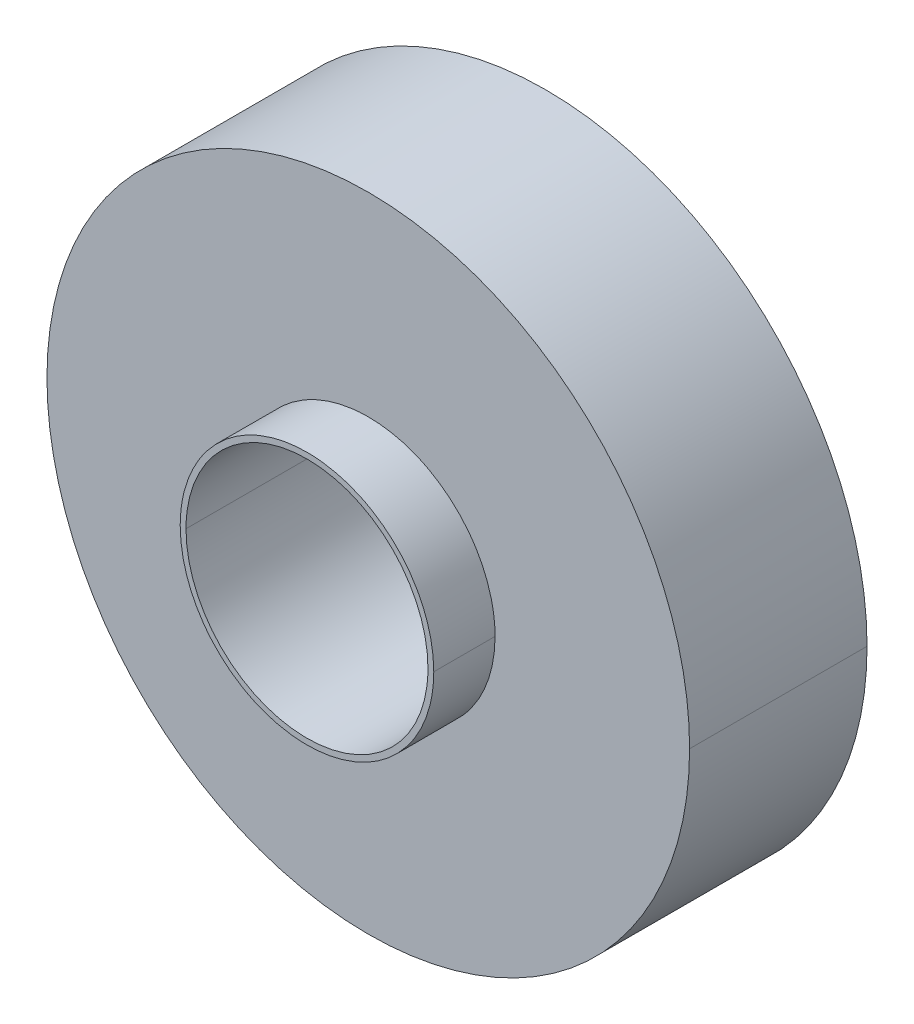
ISO-10303-21;
HEADER;
FILE_DESCRIPTION(('STEP AP214'),'2;1');
FILE_NAME('part.step','',(''),(''),'','','');
FILE_SCHEMA(('AUTOMOTIVE_DESIGN { 1 0 10303 214 1 1 1 1 }'));
ENDSEC;
DATA;
#1=APPLICATION_CONTEXT('core data for automotive mechanical design processes');
#2=APPLICATION_PROTOCOL_DEFINITION('international standard','automotive_design',2000,#1);
#3=PRODUCT_CONTEXT('',#1,'mechanical');
#4=PRODUCT('Part','Part','',(#3));
#5=PRODUCT_RELATED_PRODUCT_CATEGORY('part','',(#4));
#6=PRODUCT_DEFINITION_FORMATION('','',#4);
#7=PRODUCT_DEFINITION_CONTEXT('part definition',#1,'design');
#8=PRODUCT_DEFINITION('design','',#6,#7);
#9=PRODUCT_DEFINITION_SHAPE('','',#8);
#10=(LENGTH_UNIT() NAMED_UNIT(*) SI_UNIT(.MILLI.,.METRE.));
#11=(NAMED_UNIT(*) PLANE_ANGLE_UNIT() SI_UNIT($,.RADIAN.));
#12=(NAMED_UNIT(*) SI_UNIT($,.STERADIAN.) SOLID_ANGLE_UNIT());
#13=UNCERTAINTY_MEASURE_WITH_UNIT(LENGTH_MEASURE(1.E-05),#10,'distance_accuracy_value','');
#14=(GEOMETRIC_REPRESENTATION_CONTEXT(3) GLOBAL_UNCERTAINTY_ASSIGNED_CONTEXT((#13)) GLOBAL_UNIT_ASSIGNED_CONTEXT((#10,
#11,#12)) REPRESENTATION_CONTEXT('',''));
#15=CARTESIAN_POINT('',(0.,0.,0.));
#16=DIRECTION('',(0.,0.,1.));
#17=DIRECTION('',(1.,0.,0.));
#18=AXIS2_PLACEMENT_3D('',#15,#16,#17);
#19=CARTESIAN_POINT('',(0.,0.,9.398));
#20=DIRECTION('',(0.,0.,-1.));
#21=DIRECTION('',(1.,0.,0.));
#22=AXIS2_PLACEMENT_3D('',#19,#20,#21);
#23=CYLINDRICAL_SURFACE('',#22,4.9911);
#24=CARTESIAN_POINT('',(4.9911,0.,6.985));
#25=CARTESIAN_POINT('',(4.99079421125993,-0.75264427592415,6.985));
#26=CARTESIAN_POINT('',(4.8180996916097,-1.50480685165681,6.985));
#27=CARTESIAN_POINT('',(4.17316889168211,-2.83154301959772,6.985));
#28=CARTESIAN_POINT('',(3.71413931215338,-3.41123513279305,6.985));
#29=CARTESIAN_POINT('',(2.6167099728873,-4.30633408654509,6.985));
#30=CARTESIAN_POINT('',(1.98681979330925,-4.63098111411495,6.985));
#31=CARTESIAN_POINT('',(0.514954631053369,-5.03383761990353,6.985));
#32=CARTESIAN_POINT('',(-0.343155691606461,-5.04845629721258,6.985));
#33=CARTESIAN_POINT('',(-1.9304872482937,-4.67168537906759,6.985));
#34=CARTESIAN_POINT('',(-2.66196299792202,-4.29678420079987,6.985));
#35=CARTESIAN_POINT('',(-3.84620766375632,-3.27185753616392,6.985));
#36=CARTESIAN_POINT('',(-4.30816030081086,-2.63428988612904,6.985));
#37=CARTESIAN_POINT('',(-4.85880196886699,-1.31841290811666,6.985));
#38=CARTESIAN_POINT('',(-4.99083212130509,-0.65933548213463,6.985));
#39=CARTESIAN_POINT('',(-4.9911,0.,6.985));
#40=B_SPLINE_CURVE_WITH_KNOTS('',3,(#24,#25,#26,#27,#28,#29,#30,#31,#32,#33,#34,#35,#36,#37,#38,
#39),.UNSPECIFIED.,.F.,.F.,(4,2,2,2,2,2,2,4),(0.,0.144,0.282239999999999,0.414950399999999,
0.574202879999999,0.727085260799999,0.873852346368,1.),.UNSPECIFIED.);
#41=CARTESIAN_POINT('',(4.9911,0.,6.985));
#42=VERTEX_POINT('',#41);
#43=CARTESIAN_POINT('',(-4.9911,0.,6.985));
#44=VERTEX_POINT('',#43);
#45=EDGE_CURVE('E24',#42,#44,#40,.T.);
#46=ORIENTED_EDGE('',*,*,#45,.F.);
#47=CARTESIAN_POINT('',(4.9911,0.,9.398));
#48=CARTESIAN_POINT('',(4.9911,0.,9.37789166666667));
#49=CARTESIAN_POINT('',(4.9911,0.,9.35778333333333));
#50=CARTESIAN_POINT('',(4.9911,0.,9.31756666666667));
#51=CARTESIAN_POINT('',(4.9911,0.,9.29745833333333));
#52=CARTESIAN_POINT('',(4.9911,0.,9.25724166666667));
#53=CARTESIAN_POINT('',(4.9911,0.,9.23713333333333));
#54=CARTESIAN_POINT('',(4.9911,0.,9.19691666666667));
#55=CARTESIAN_POINT('',(4.9911,0.,9.17680833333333));
#56=CARTESIAN_POINT('',(4.9911,0.,9.13659166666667));
#57=CARTESIAN_POINT('',(4.9911,0.,9.11648333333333));
#58=CARTESIAN_POINT('',(4.9911,0.,9.07626666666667));
#59=CARTESIAN_POINT('',(4.9911,0.,9.05615833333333));
#60=CARTESIAN_POINT('',(4.9911,0.,9.01594166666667));
#61=CARTESIAN_POINT('',(4.9911,0.,8.99583333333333));
#62=CARTESIAN_POINT('',(4.9911,0.,8.95561666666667));
#63=CARTESIAN_POINT('',(4.9911,0.,8.93550833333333));
#64=CARTESIAN_POINT('',(4.9911,0.,8.89529166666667));
#65=CARTESIAN_POINT('',(4.9911,0.,8.87518333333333));
#66=CARTESIAN_POINT('',(4.9911,0.,8.83496666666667));
#67=CARTESIAN_POINT('',(4.9911,0.,8.81485833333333));
#68=CARTESIAN_POINT('',(4.9911,0.,8.77464166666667));
#69=CARTESIAN_POINT('',(4.9911,0.,8.75453333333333));
#70=CARTESIAN_POINT('',(4.9911,0.,8.71431666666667));
#71=CARTESIAN_POINT('',(4.9911,0.,8.69420833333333));
#72=CARTESIAN_POINT('',(4.9911,0.,8.65399166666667));
#73=CARTESIAN_POINT('',(4.9911,0.,8.63388333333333));
#74=CARTESIAN_POINT('',(4.9911,0.,8.59366666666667));
#75=CARTESIAN_POINT('',(4.9911,0.,8.57355833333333));
#76=CARTESIAN_POINT('',(4.9911,0.,8.53334166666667));
#77=CARTESIAN_POINT('',(4.9911,0.,8.51323333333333));
#78=CARTESIAN_POINT('',(4.9911,0.,8.47301666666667));
#79=CARTESIAN_POINT('',(4.9911,0.,8.45290833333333));
#80=CARTESIAN_POINT('',(4.9911,0.,8.41269166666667));
#81=CARTESIAN_POINT('',(4.9911,0.,8.39258333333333));
#82=CARTESIAN_POINT('',(4.9911,0.,8.35236666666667));
#83=CARTESIAN_POINT('',(4.9911,0.,8.33225833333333));
#84=CARTESIAN_POINT('',(4.9911,0.,8.29204166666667));
#85=CARTESIAN_POINT('',(4.9911,0.,8.27193333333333));
#86=CARTESIAN_POINT('',(4.9911,0.,8.23171666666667));
#87=CARTESIAN_POINT('',(4.9911,0.,8.21160833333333));
#88=CARTESIAN_POINT('',(4.9911,0.,8.17139166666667));
#89=CARTESIAN_POINT('',(4.9911,0.,8.15128333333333));
#90=CARTESIAN_POINT('',(4.9911,0.,8.11106666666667));
#91=CARTESIAN_POINT('',(4.9911,0.,8.09095833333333));
#92=CARTESIAN_POINT('',(4.9911,0.,8.05074166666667));
#93=CARTESIAN_POINT('',(4.9911,0.,8.03063333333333));
#94=CARTESIAN_POINT('',(4.9911,0.,7.99041666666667));
#95=CARTESIAN_POINT('',(4.9911,0.,7.97030833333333));
#96=CARTESIAN_POINT('',(4.9911,0.,7.93009166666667));
#97=CARTESIAN_POINT('',(4.9911,0.,7.90998333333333));
#98=CARTESIAN_POINT('',(4.9911,0.,7.86976666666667));
#99=CARTESIAN_POINT('',(4.9911,0.,7.84965833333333));
#100=CARTESIAN_POINT('',(4.9911,0.,7.80944166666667));
#101=CARTESIAN_POINT('',(4.9911,0.,7.78933333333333));
#102=CARTESIAN_POINT('',(4.9911,0.,7.74911666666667));
#103=CARTESIAN_POINT('',(4.9911,0.,7.72900833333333));
#104=CARTESIAN_POINT('',(4.9911,0.,7.68879166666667));
#105=CARTESIAN_POINT('',(4.9911,0.,7.66868333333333));
#106=CARTESIAN_POINT('',(4.9911,0.,7.62846666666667));
#107=CARTESIAN_POINT('',(4.9911,0.,7.60835833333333));
#108=CARTESIAN_POINT('',(4.9911,0.,7.56814166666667));
#109=CARTESIAN_POINT('',(4.9911,0.,7.54803333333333));
#110=CARTESIAN_POINT('',(4.9911,0.,7.50781666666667));
#111=CARTESIAN_POINT('',(4.9911,0.,7.48770833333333));
#112=CARTESIAN_POINT('',(4.9911,0.,7.44749166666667));
#113=CARTESIAN_POINT('',(4.9911,0.,7.42738333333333));
#114=CARTESIAN_POINT('',(4.9911,0.,7.38716666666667));
#115=CARTESIAN_POINT('',(4.9911,0.,7.36705833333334));
#116=CARTESIAN_POINT('',(4.9911,0.,7.32684166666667));
#117=CARTESIAN_POINT('',(4.9911,0.,7.30673333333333));
#118=CARTESIAN_POINT('',(4.9911,0.,7.26651666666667));
#119=CARTESIAN_POINT('',(4.9911,0.,7.24640833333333));
#120=CARTESIAN_POINT('',(4.9911,0.,7.20619166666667));
#121=CARTESIAN_POINT('',(4.9911,0.,7.18608333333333));
#122=CARTESIAN_POINT('',(4.9911,0.,7.14586666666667));
#123=CARTESIAN_POINT('',(4.9911,0.,7.12575833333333));
#124=CARTESIAN_POINT('',(4.9911,0.,7.08554166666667));
#125=CARTESIAN_POINT('',(4.9911,0.,7.06543333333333));
#126=CARTESIAN_POINT('',(4.9911,0.,7.02521666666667));
#127=CARTESIAN_POINT('',(4.9911,0.,7.00510833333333));
#128=CARTESIAN_POINT('',(4.9911,0.,6.985));
#129=B_SPLINE_CURVE_WITH_KNOTS('',3,(#47,#48,#49,#50,#51,#52,#53,#54,#55,#56,#57,#58,#59,#60,
#61,#62,#63,#64,#65,#66,#67,#68,#69,#70,#71,#72,#73,#74,#75,#76,#77,#78,#79,#80,#81,#82,#83,#84,
#85,#86,#87,#88,#89,#90,#91,#92,#93,#94,#95,#96,#97,#98,#99,#100,#101,#102,#103,#104,#105,#106,
#107,#108,#109,#110,#111,#112,#113,#114,#115,#116,#117,#118,#119,#120,#121,#122,#123,#124,#125,
#126,#127,#128),.UNSPECIFIED.,.F.,.F.,(4,2,2,2,2,2,2,2,2,2,2,2,2,2,2,2,2,2,2,2,2,2,2,2,2,2,2,2,
2,2,2,2,2,2,2,2,2,2,2,2,4),(0.,0.060325,0.12065,0.180975,0.2413,0.301625,0.36195,0.422275,
0.4826,0.542925,0.60325,0.663575,0.7239,0.784225,0.844549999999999,0.904874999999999,
0.965199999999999,1.025525,1.08585,1.146175,1.2065,1.266825,1.32715,1.387475,1.4478,1.508125,
1.56845,1.628775,1.6891,1.749425,1.80975,1.870075,1.9304,1.990725,2.05105,2.111375,2.1717,
2.232025,2.29235,2.352675,2.413),.UNSPECIFIED.);
#130=CARTESIAN_POINT('',(4.9911,0.,9.398));
#131=VERTEX_POINT('',#130);
#132=EDGE_CURVE('E33',#131,#42,#129,.T.);
#133=ORIENTED_EDGE('',*,*,#132,.F.);
#134=CARTESIAN_POINT('',(-4.9911,0.,9.398));
#135=CARTESIAN_POINT('',(-4.99079421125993,-0.752644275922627,9.398));
#136=CARTESIAN_POINT('',(-4.81809969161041,-1.50480685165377,9.398));
#137=CARTESIAN_POINT('',(-4.17316889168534,-2.8315430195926,9.398));
#138=CARTESIAN_POINT('',(-3.71413931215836,-3.41123513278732,9.398));
#139=CARTESIAN_POINT('',(-2.6167099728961,-4.30633408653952,9.398));
#140=CARTESIAN_POINT('',(-1.9868197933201,-4.63098111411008,9.398));
#141=CARTESIAN_POINT('',(-0.514954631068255,-5.03383761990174,9.398));
#142=CARTESIAN_POINT('',(0.34315569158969,-5.04845629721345,9.398));
#143=CARTESIAN_POINT('',(1.9304872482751,-4.67168537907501,9.398));
#144=CARTESIAN_POINT('',(2.66196299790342,-4.2967842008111,9.398));
#145=CARTESIAN_POINT('',(3.84620766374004,-3.27185753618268,9.398));
#146=CARTESIAN_POINT('',(4.30816030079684,-2.63428988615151,9.398));
#147=CARTESIAN_POINT('',(4.85880196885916,-1.31841290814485,9.398));
#148=CARTESIAN_POINT('',(4.99083212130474,-0.659335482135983,9.398));
#149=CARTESIAN_POINT('',(4.9911,-2.68361721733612E-12,9.398));
#150=B_SPLINE_CURVE_WITH_KNOTS('',3,(#134,#135,#136,#137,#138,#139,#140,#141,#142,#143,#144,
#145,#146,#147,#148,#149),.UNSPECIFIED.,.F.,.F.,(4,2,2,2,2,2,2,4),(0.,0.144,0.28224,0.4149504,
0.57420288,0.7270852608,0.873852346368,1.),.UNSPECIFIED.);
#151=CARTESIAN_POINT('',(-4.9911,0.,9.398));
#152=VERTEX_POINT('',#151);
#153=EDGE_CURVE('E288',#152,#131,#150,.T.);
#154=ORIENTED_EDGE('',*,*,#153,.F.);
#155=CARTESIAN_POINT('',(-4.9911,0.,9.398));
#156=CARTESIAN_POINT('',(-4.9911,0.,9.37789166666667));
#157=CARTESIAN_POINT('',(-4.9911,0.,9.35778333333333));
#158=CARTESIAN_POINT('',(-4.9911,0.,9.31756666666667));
#159=CARTESIAN_POINT('',(-4.9911,0.,9.29745833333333));
#160=CARTESIAN_POINT('',(-4.9911,0.,9.25724166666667));
#161=CARTESIAN_POINT('',(-4.9911,0.,9.23713333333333));
#162=CARTESIAN_POINT('',(-4.9911,0.,9.19691666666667));
#163=CARTESIAN_POINT('',(-4.9911,0.,9.17680833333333));
#164=CARTESIAN_POINT('',(-4.9911,0.,9.13659166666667));
#165=CARTESIAN_POINT('',(-4.9911,0.,9.11648333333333));
#166=CARTESIAN_POINT('',(-4.9911,0.,9.07626666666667));
#167=CARTESIAN_POINT('',(-4.9911,0.,9.05615833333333));
#168=CARTESIAN_POINT('',(-4.9911,0.,9.01594166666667));
#169=CARTESIAN_POINT('',(-4.9911,0.,8.99583333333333));
#170=CARTESIAN_POINT('',(-4.9911,0.,8.95561666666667));
#171=CARTESIAN_POINT('',(-4.9911,0.,8.93550833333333));
#172=CARTESIAN_POINT('',(-4.9911,0.,8.89529166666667));
#173=CARTESIAN_POINT('',(-4.9911,0.,8.87518333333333));
#174=CARTESIAN_POINT('',(-4.9911,0.,8.83496666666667));
#175=CARTESIAN_POINT('',(-4.9911,0.,8.81485833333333));
#176=CARTESIAN_POINT('',(-4.9911,0.,8.77464166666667));
#177=CARTESIAN_POINT('',(-4.9911,0.,8.75453333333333));
#178=CARTESIAN_POINT('',(-4.9911,0.,8.71431666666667));
#179=CARTESIAN_POINT('',(-4.9911,0.,8.69420833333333));
#180=CARTESIAN_POINT('',(-4.9911,0.,8.65399166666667));
#181=CARTESIAN_POINT('',(-4.9911,0.,8.63388333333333));
#182=CARTESIAN_POINT('',(-4.9911,0.,8.59366666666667));
#183=CARTESIAN_POINT('',(-4.9911,0.,8.57355833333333));
#184=CARTESIAN_POINT('',(-4.9911,0.,8.53334166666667));
#185=CARTESIAN_POINT('',(-4.9911,0.,8.51323333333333));
#186=CARTESIAN_POINT('',(-4.9911,0.,8.47301666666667));
#187=CARTESIAN_POINT('',(-4.9911,0.,8.45290833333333));
#188=CARTESIAN_POINT('',(-4.9911,0.,8.41269166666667));
#189=CARTESIAN_POINT('',(-4.9911,0.,8.39258333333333));
#190=CARTESIAN_POINT('',(-4.9911,0.,8.35236666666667));
#191=CARTESIAN_POINT('',(-4.9911,0.,8.33225833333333));
#192=CARTESIAN_POINT('',(-4.9911,0.,8.29204166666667));
#193=CARTESIAN_POINT('',(-4.9911,0.,8.27193333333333));
#194=CARTESIAN_POINT('',(-4.9911,0.,8.23171666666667));
#195=CARTESIAN_POINT('',(-4.9911,0.,8.21160833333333));
#196=CARTESIAN_POINT('',(-4.9911,0.,8.17139166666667));
#197=CARTESIAN_POINT('',(-4.9911,0.,8.15128333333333));
#198=CARTESIAN_POINT('',(-4.9911,0.,8.11106666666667));
#199=CARTESIAN_POINT('',(-4.9911,0.,8.09095833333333));
#200=CARTESIAN_POINT('',(-4.9911,0.,8.05074166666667));
#201=CARTESIAN_POINT('',(-4.9911,0.,8.03063333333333));
#202=CARTESIAN_POINT('',(-4.9911,0.,7.99041666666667));
#203=CARTESIAN_POINT('',(-4.9911,0.,7.97030833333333));
#204=CARTESIAN_POINT('',(-4.9911,0.,7.93009166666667));
#205=CARTESIAN_POINT('',(-4.9911,0.,7.90998333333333));
#206=CARTESIAN_POINT('',(-4.9911,0.,7.86976666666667));
#207=CARTESIAN_POINT('',(-4.9911,0.,7.84965833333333));
#208=CARTESIAN_POINT('',(-4.9911,0.,7.80944166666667));
#209=CARTESIAN_POINT('',(-4.9911,0.,7.78933333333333));
#210=CARTESIAN_POINT('',(-4.9911,0.,7.74911666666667));
#211=CARTESIAN_POINT('',(-4.9911,0.,7.72900833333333));
#212=CARTESIAN_POINT('',(-4.9911,0.,7.68879166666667));
#213=CARTESIAN_POINT('',(-4.9911,0.,7.66868333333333));
#214=CARTESIAN_POINT('',(-4.9911,0.,7.62846666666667));
#215=CARTESIAN_POINT('',(-4.9911,0.,7.60835833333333));
#216=CARTESIAN_POINT('',(-4.9911,0.,7.56814166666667));
#217=CARTESIAN_POINT('',(-4.9911,0.,7.54803333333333));
#218=CARTESIAN_POINT('',(-4.9911,0.,7.50781666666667));
#219=CARTESIAN_POINT('',(-4.9911,0.,7.48770833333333));
#220=CARTESIAN_POINT('',(-4.9911,0.,7.44749166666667));
#221=CARTESIAN_POINT('',(-4.9911,0.,7.42738333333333));
#222=CARTESIAN_POINT('',(-4.9911,0.,7.38716666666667));
#223=CARTESIAN_POINT('',(-4.9911,0.,7.36705833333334));
#224=CARTESIAN_POINT('',(-4.9911,0.,7.32684166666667));
#225=CARTESIAN_POINT('',(-4.9911,0.,7.30673333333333));
#226=CARTESIAN_POINT('',(-4.9911,0.,7.26651666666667));
#227=CARTESIAN_POINT('',(-4.9911,0.,7.24640833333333));
#228=CARTESIAN_POINT('',(-4.9911,0.,7.20619166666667));
#229=CARTESIAN_POINT('',(-4.9911,0.,7.18608333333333));
#230=CARTESIAN_POINT('',(-4.9911,0.,7.14586666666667));
#231=CARTESIAN_POINT('',(-4.9911,0.,7.12575833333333));
#232=CARTESIAN_POINT('',(-4.9911,0.,7.08554166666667));
#233=CARTESIAN_POINT('',(-4.9911,0.,7.06543333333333));
#234=CARTESIAN_POINT('',(-4.9911,0.,7.02521666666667));
#235=CARTESIAN_POINT('',(-4.9911,0.,7.00510833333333));
#236=CARTESIAN_POINT('',(-4.9911,0.,6.985));
#237=B_SPLINE_CURVE_WITH_KNOTS('',3,(#155,#156,#157,#158,#159,#160,#161,#162,#163,#164,#165,
#166,#167,#168,#169,#170,#171,#172,#173,#174,#175,#176,#177,#178,#179,#180,#181,#182,#183,#184,
#185,#186,#187,#188,#189,#190,#191,#192,#193,#194,#195,#196,#197,#198,#199,#200,#201,#202,#203,
#204,#205,#206,#207,#208,#209,#210,#211,#212,#213,#214,#215,#216,#217,#218,#219,#220,#221,#222,
#223,#224,#225,#226,#227,#228,#229,#230,#231,#232,#233,#234,#235,#236),.UNSPECIFIED.,.F.,.F.,(4,
2,2,2,2,2,2,2,2,2,2,2,2,2,2,2,2,2,2,2,2,2,2,2,2,2,2,2,2,2,2,2,2,2,2,2,2,2,2,2,4),(0.,0.060325,
0.12065,0.180975,0.2413,0.301625,0.36195,0.422275,0.4826,0.542925,0.60325,0.663575,0.7239,
0.784225,0.844549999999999,0.904874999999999,0.965199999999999,1.025525,1.08585,1.146175,1.2065,
1.266825,1.32715,1.387475,1.4478,1.508125,1.56845,1.628775,1.6891,1.749425,1.80975,1.870075,
1.9304,1.990725,2.05105,2.111375,2.1717,2.232025,2.29235,2.352675,2.413),.UNSPECIFIED.);
#238=EDGE_CURVE('E10',#152,#44,#237,.T.);
#239=ORIENTED_EDGE('',*,*,#238,.T.);
#240=EDGE_LOOP('',(#46,#133,#154,#239));
#241=FACE_BOUND('',#240,.T.);
#242=ADVANCED_FACE('F15',(#241),#23,.T.);
#243=CARTESIAN_POINT('',(-12.6492,-13.0865455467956,6.985));
#244=DIRECTION('',(0.,0.,1.));
#245=DIRECTION('',(1.,0.,0.));
#246=AXIS2_PLACEMENT_3D('',#243,#244,#245);
#247=PLANE('',#246);
#248=CARTESIAN_POINT('',(12.6492,0.,6.985));
#249=CARTESIAN_POINT('',(12.6492027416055,-0.183975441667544,6.985));
#250=CARTESIAN_POINT('',(12.6451863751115,-0.367950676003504,6.985));
#251=CARTESIAN_POINT('',(12.6291351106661,-0.735551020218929,6.985));
#252=CARTESIAN_POINT('',(12.6171002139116,-0.919176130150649,6.985));
#253=CARTESIAN_POINT('',(12.5850315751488,-1.28572655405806,6.985));
#254=CARTESIAN_POINT('',(12.5649978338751,-1.46865186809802,6.985));
#255=CARTESIAN_POINT('',(12.5169705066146,-1.83345453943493,6.985));
#256=CARTESIAN_POINT('',(12.4889769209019,-2.01533189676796,6.985));
#257=CARTESIAN_POINT('',(12.4250829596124,-2.37769244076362,6.985));
#258=CARTESIAN_POINT('',(12.389182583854,-2.55817562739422,6.985));
#259=CARTESIAN_POINT('',(12.3095434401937,-2.91740428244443,6.985));
#260=CARTESIAN_POINT('',(12.2658046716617,-3.09614975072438,6.985));
#261=CARTESIAN_POINT('',(12.1705719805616,-3.45156272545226,6.985));
#262=CARTESIAN_POINT('',(12.119078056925,-3.6282302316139,6.985));
#263=CARTESIAN_POINT('',(12.0084330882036,-3.9791509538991,6.985));
#264=CARTESIAN_POINT('',(11.9492820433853,-4.15340417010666,6.985));
#265=CARTESIAN_POINT('',(11.8234354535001,-4.49916454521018,6.985));
#266=CARTESIAN_POINT('',(11.7567399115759,-4.67067170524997,6.985));
#267=CARTESIAN_POINT('',(11.6159312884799,-5.01061351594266,6.985));
#268=CARTESIAN_POINT('',(11.5418182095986,-5.17904816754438,6.985));
#269=CARTESIAN_POINT('',(11.3863155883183,-5.51252435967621,6.985));
#270=CARTESIAN_POINT('',(11.3049260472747,-5.67756590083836,6.985));
#271=CARTESIAN_POINT('',(11.1350254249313,-6.00394172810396,6.985));
#272=CARTESIAN_POINT('',(11.0465143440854,-6.16527601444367,6.985));
#273=CARTESIAN_POINT('',(10.8625391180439,-6.48393024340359,6.985));
#274=CARTESIAN_POINT('',(10.7670749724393,-6.64125018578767,6.985));
#275=CARTESIAN_POINT('',(10.5693753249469,-6.95157627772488,6.985));
#276=CARTESIAN_POINT('',(10.4671398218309,-7.10458242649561,6.985));
#277=CARTESIAN_POINT('',(10.2560920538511,-7.40598969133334,6.985));
#278=CARTESIAN_POINT('',(10.1472797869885,-7.55439080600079,6.985));
#279=CARTESIAN_POINT('',(9.9232856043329,-7.84630552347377,6.985));
#280=CARTESIAN_POINT('',(9.8081036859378,-7.98981912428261,6.985));
#281=CARTESIAN_POINT('',(9.57158953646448,-8.271685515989,6.985));
#282=CARTESIAN_POINT('',(9.45025730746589,-8.41003830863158,6.985));
#283=CARTESIAN_POINT('',(9.20167354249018,-8.68131968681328,6.985));
#284=CARTESIAN_POINT('',(9.0744220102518,-8.81424827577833,6.985));
#285=CARTESIAN_POINT('',(8.81424185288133,-9.07442824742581,6.985));
#286=CARTESIAN_POINT('',(8.68131323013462,-9.2016796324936,6.985));
#287=CARTESIAN_POINT('',(8.4100319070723,-9.45026299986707,6.985));
#288=CARTESIAN_POINT('',(8.27167920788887,-9.57159498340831,6.985));
#289=CARTESIAN_POINT('',(7.98981306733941,-9.80810861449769,6.985));
#290=CARTESIAN_POINT('',(7.84629962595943,-9.92329026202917,6.985));
#291=CARTESIAN_POINT('',(7.55438515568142,-10.1472839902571,6.985));
#292=CARTESIAN_POINT('',(7.40598412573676,-10.2560960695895,6.985));
#293=CARTESIAN_POINT('',(7.10457693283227,-10.4671435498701,6.985));
#294=CARTESIAN_POINT('',(6.95157076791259,-10.5693789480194,6.985));
#295=CARTESIAN_POINT('',(6.64124452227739,-10.7670784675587,6.985));
#296=CARTESIAN_POINT('',(6.48392443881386,-10.8625425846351,6.985));
#297=CARTESIAN_POINT('',(6.16526990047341,-11.0465177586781,6.985));
#298=CARTESIAN_POINT('',(6.00393544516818,-11.1350288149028,6.985));
#299=CARTESIAN_POINT('',(5.67755942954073,-11.304929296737,6.985));
#300=CARTESIAN_POINT('',(5.51251787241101,-11.3863187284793,6.985));
#301=CARTESIAN_POINT('',(5.17904178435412,-11.5418210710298,6.985));
#302=CARTESIAN_POINT('',(5.01060725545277,-11.6159339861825,6.985));
#303=CARTESIAN_POINT('',(4.67066580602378,-11.756742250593,6.985));
#304=CARTESIAN_POINT('',(4.4991588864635,-11.8234376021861,6.985));
#305=CARTESIAN_POINT('',(4.15339908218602,-11.9492838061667,6.985));
#306=CARTESIAN_POINT('',(3.97914619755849,-12.0084346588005,6.985));
#307=CARTESIAN_POINT('',(3.62822611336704,-12.1190792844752,6.985));
#308=CARTESIAN_POINT('',(3.45155891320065,-12.1705730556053,6.985));
#309=CARTESIAN_POINT('',(3.0961464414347,-12.2658055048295,6.985));
#310=CARTESIAN_POINT('',(2.91740116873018,-12.3095441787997,6.985));
#311=CARTESIAN_POINT('',(2.55817274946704,-12.3891831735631,6.985));
#312=CARTESIAN_POINT('',(2.377689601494,-12.4250834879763,6.985));
#313=CARTESIAN_POINT('',(2.01532911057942,-12.4889773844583,6.985));
#314=CARTESIAN_POINT('',(1.83345176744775,-12.5169709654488,6.985));
#315=CARTESIAN_POINT('',(1.46864929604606,-12.5649980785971,6.985));
#316=CARTESIAN_POINT('',(1.28572416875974,-12.5850316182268,6.985));
#317=CARTESIAN_POINT('',(0.919174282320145,-12.6171005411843,6.985));
#318=CARTESIAN_POINT('',(0.735549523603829,-12.6291359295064,6.985));
#319=CARTESIAN_POINT('',(0.367949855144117,-12.6451856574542,6.985));
#320=CARTESIAN_POINT('',(0.183974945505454,-12.6491999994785,6.985));
#321=CARTESIAN_POINT('',(-0.183974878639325,-12.6492000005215,6.985));
#322=CARTESIAN_POINT('',(-0.367949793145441,-12.6451856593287,6.985));
#323=CARTESIAN_POINT('',(-0.735549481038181,-12.6291359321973,6.985));
#324=CARTESIAN_POINT('',(-0.919174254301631,-12.6171005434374,6.985));
#325=CARTESIAN_POINT('',(-1.28572417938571,-12.5850316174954,6.985));
#326=CARTESIAN_POINT('',(-1.46864933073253,-12.5649980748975,6.985));
#327=CARTESIAN_POINT('',(-1.83345184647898,-12.5169709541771,6.985));
#328=CARTESIAN_POINT('',(-2.01532920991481,-12.4889773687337,6.985));
#329=CARTESIAN_POINT('',(-2.37768968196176,-12.4250834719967,6.985));
#330=CARTESIAN_POINT('',(-2.55817279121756,-12.3891831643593,6.985));
#331=CARTESIAN_POINT('',(-2.91740113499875,-12.3095441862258,6.985));
#332=CARTESIAN_POINT('',(-3.09614637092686,-12.2658055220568,6.985));
#333=CARTESIAN_POINT('',(-3.45155878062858,-12.1705730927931,6.985));
#334=CARTESIAN_POINT('',(-3.62822595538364,-12.1190793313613,6.985));
#335=CARTESIAN_POINT('',(-3.97914600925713,-12.0084347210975,6.985));
#336=CARTESIAN_POINT('',(-4.1533988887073,-11.9492838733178,6.985));
#337=CARTESIAN_POINT('',(-4.49915871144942,-11.8234376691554,6.985));
#338=CARTESIAN_POINT('',(-4.67066565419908,-11.7567423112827,6.985));
#339=CARTESIAN_POINT('',(-5.01060718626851,-11.6159340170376,6.985));
#340=CARTESIAN_POINT('',(-5.17904177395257,-11.5418210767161,6.985));
#341=CARTESIAN_POINT('',(-5.51251802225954,-11.3863186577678,6.985));
#342=CARTESIAN_POINT('',(-5.6775596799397,-11.3049291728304,6.985));
#343=CARTESIAN_POINT('',(-6.00393580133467,-11.1350286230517,6.985));
#344=CARTESIAN_POINT('',(-6.16527026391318,-11.0465175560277,6.985));
#345=CARTESIAN_POINT('',(-6.48392472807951,-10.8625424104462,6.985));
#346=CARTESIAN_POINT('',(-6.64124473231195,-10.7670783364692,6.985));
#347=CARTESIAN_POINT('',(-6.95157084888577,-10.5693788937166,6.985));
#348=CARTESIAN_POINT('',(-7.10457696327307,-10.4671435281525,6.985));
#349=CARTESIAN_POINT('',(-7.40598407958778,-10.2560961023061,6.985));
#350=CARTESIAN_POINT('',(-7.55438508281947,-10.1472840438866,6.985));
#351=CARTESIAN_POINT('',(-7.84629951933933,-9.92329034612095,6.985));
#352=CARTESIAN_POINT('',(-7.98981295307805,-9.8081087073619,6.985));
#353=CARTESIAN_POINT('',(-8.27167909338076,-9.57159508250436,6.985));
#354=CARTESIAN_POINT('',(-8.41003179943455,-9.45026309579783,6.985));
#355=CARTESIAN_POINT('',(-8.68131314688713,-9.20167971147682,6.985));
#356=CARTESIAN_POINT('',(-8.81424178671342,-9.07442831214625,6.985));
#357=CARTESIAN_POINT('',(-9.07442198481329,-8.81424830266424,6.985));
#358=CARTESIAN_POINT('',(-9.20167354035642,-8.68131968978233,6.985));
#359=CARTESIAN_POINT('',(-9.45025735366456,-8.41003825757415,6.985));
#360=CARTESIAN_POINT('',(-9.57158960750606,-8.27168543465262,6.985));
#361=CARTESIAN_POINT('',(-9.80810376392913,-7.98981902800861,6.985));
#362=CARTESIAN_POINT('',(-9.92328566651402,-7.84630544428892,6.985));
#363=CARTESIAN_POINT('',(-10.1472798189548,-7.55439076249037,6.985));
#364=CARTESIAN_POINT('',(-10.2560920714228,-7.40598966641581,6.985));
#365=CARTESIAN_POINT('',(-10.4671398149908,-7.10458243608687,6.985));
#366=CARTESIAN_POINT('',(-10.5693753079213,-6.95157630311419,6.985));
#367=CARTESIAN_POINT('',(-10.7670749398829,-6.6412502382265,6.985));
#368=CARTESIAN_POINT('',(-10.8625390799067,-6.48393030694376,6.985));
#369=CARTESIAN_POINT('',(-11.0465142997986,-6.16527609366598,6.985));
#370=CARTESIAN_POINT('',(-11.1350253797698,-6.0039418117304,6.985));
#371=CARTESIAN_POINT('',(-11.3049260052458,-5.67756598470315,6.985));
#372=CARTESIAN_POINT('',(-11.3863155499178,-5.51252443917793,6.985));
#373=CARTESIAN_POINT('',(-11.5418181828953,-5.17904822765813,6.985));
#374=CARTESIAN_POINT('',(-11.6159312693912,-5.01061356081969,6.985));
#375=CARTESIAN_POINT('',(-11.7567399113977,-4.67067170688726,6.985));
#376=CARTESIAN_POINT('',(-11.8234354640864,-4.49916451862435,6.985));
#377=CARTESIAN_POINT('',(-11.9492820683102,-4.15340409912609,6.985));
#378=CARTESIAN_POINT('',(-12.0084331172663,-3.97915086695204,6.985));
#379=CARTESIAN_POINT('',(-12.1190780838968,-3.62823014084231,6.985));
#380=CARTESIAN_POINT('',(-12.170572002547,-3.4515626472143,6.985));
#381=CARTESIAN_POINT('',(-12.265804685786,-3.0961496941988,6.985));
#382=CARTESIAN_POINT('',(-12.3095434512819,-2.91740423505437,6.985));
#383=CARTESIAN_POINT('',(-12.3891825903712,-2.55817559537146,6.985));
#384=CARTESIAN_POINT('',(-12.4250829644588,-2.37769241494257,6.985));
#385=CARTESIAN_POINT('',(-12.4889769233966,-2.01533188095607,6.985));
#386=CARTESIAN_POINT('',(-12.5169705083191,-1.83345452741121,6.985));
#387=CARTESIAN_POINT('',(-12.5649978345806,-1.46865186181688,6.985));
#388=CARTESIAN_POINT('',(-12.5850315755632,-1.28572654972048,6.985));
#389=CARTESIAN_POINT('',(-12.6171002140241,-0.919176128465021,6.985));
#390=CARTESIAN_POINT('',(-12.6291351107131,-0.73555101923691,6.985));
#391=CARTESIAN_POINT('',(-12.6451863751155,-0.367950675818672,6.985));
#392=CARTESIAN_POINT('',(-12.6492027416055,-0.183975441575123,6.985));
#393=CARTESIAN_POINT('',(-12.6492,0.,6.985));
#394=B_SPLINE_CURVE_WITH_KNOTS('',3,(#248,#249,#250,#251,#252,#253,#254,#255,#256,#257,#258,
#259,#260,#261,#262,#263,#264,#265,#266,#267,#268,#269,#270,#271,#272,#273,#274,#275,#276,#277,
#278,#279,#280,#281,#282,#283,#284,#285,#286,#287,#288,#289,#290,#291,#292,#293,#294,#295,#296,
#297,#298,#299,#300,#301,#302,#303,#304,#305,#306,#307,#308,#309,#310,#311,#312,#313,#314,#315,
#316,#317,#318,#319,#320,#321,#322,#323,#324,#325,#326,#327,#328,#329,#330,#331,#332,#333,#334,
#335,#336,#337,#338,#339,#340,#341,#342,#343,#344,#345,#346,#347,#348,#349,#350,#351,#352,#353,
#354,#355,#356,#357,#358,#359,#360,#361,#362,#363,#364,#365,#366,#367,#368,#369,#370,#371,#372,
#373,#374,#375,#376,#377,#378,#379,#380,#381,#382,#383,#384,#385,#386,#387,#388,#389,#390,#391,
#392,#393),.UNSPECIFIED.,.F.,.F.,(4,2,2,2,2,2,2,2,2,2,2,2,2,2,2,2,2,2,2,2,2,2,2,2,2,2,2,2,2,2,2,
2,2,2,2,2,2,2,2,2,2,2,2,2,2,2,2,2,2,2,2,2,2,2,2,2,2,2,2,2,2,2,2,2,2,2,2,2,2,2,2,2,4),(0.,
0.551882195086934,1.10376430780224,1.65564636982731,2.20752841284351,2.75941046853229,
3.31129256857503,3.86317474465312,4.4150569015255,4.96693882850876,5.51882058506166,
6.07070223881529,6.62258385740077,7.17446550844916,7.72634725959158,8.2782291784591,
8.83011132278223,9.3819932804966,9.93387488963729,10.4857562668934,11.037637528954,
11.5895187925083,12.1414001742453,12.6932817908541,13.2451637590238,13.7970457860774,
14.3489273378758,14.9008085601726,15.4526896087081,16.0045706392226,16.5564518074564,
17.1083332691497,17.6602151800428,18.2120971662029,18.7639786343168,19.3158597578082,
19.8677407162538,20.4196216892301,20.9715028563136,21.5233843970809,22.0752664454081,
22.6271482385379,23.1790295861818,23.7309106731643,24.2827916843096,24.834672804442,
25.386554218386,25.9384361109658,26.4903181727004,27.0421998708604,27.5940813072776,
28.1459625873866,28.6978438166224,29.2497251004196,29.801606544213,30.3534882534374,
30.9053703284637,31.4572524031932,32.0091342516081,32.5610159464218,33.1128975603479,
33.6647791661,34.2166608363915,34.7685426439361,35.3204246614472,35.8723068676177,
36.4241890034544,36.9760710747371,37.527953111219,38.0798351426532,38.6317171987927,
39.1835993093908,39.7354815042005),.UNSPECIFIED.);
#395=CARTESIAN_POINT('',(12.6492,0.,6.985));
#396=VERTEX_POINT('',#395);
#397=CARTESIAN_POINT('',(-12.6492,0.,6.985));
#398=VERTEX_POINT('',#397);
#399=EDGE_CURVE('E161',#396,#398,#394,.T.);
#400=ORIENTED_EDGE('',*,*,#399,.F.);
#401=CARTESIAN_POINT('',(-12.6492,0.,6.985));
#402=CARTESIAN_POINT('',(-12.6492027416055,0.183975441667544,6.985));
#403=CARTESIAN_POINT('',(-12.6451863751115,0.367950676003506,6.985));
#404=CARTESIAN_POINT('',(-12.6291351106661,0.735551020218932,6.985));
#405=CARTESIAN_POINT('',(-12.6171002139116,0.919176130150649,6.985));
#406=CARTESIAN_POINT('',(-12.5850315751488,1.28572655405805,6.985));
#407=CARTESIAN_POINT('',(-12.5649978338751,1.46865186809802,6.985));
#408=CARTESIAN_POINT('',(-12.5169705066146,1.83345453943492,6.985));
#409=CARTESIAN_POINT('',(-12.4889769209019,2.01533189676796,6.985));
#410=CARTESIAN_POINT('',(-12.4250829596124,2.37769244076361,6.985));
#411=CARTESIAN_POINT('',(-12.389182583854,2.55817562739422,6.985));
#412=CARTESIAN_POINT('',(-12.3095434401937,2.91740428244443,6.985));
#413=CARTESIAN_POINT('',(-12.2658046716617,3.09614975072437,6.985));
#414=CARTESIAN_POINT('',(-12.1705719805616,3.45156272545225,6.985));
#415=CARTESIAN_POINT('',(-12.119078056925,3.62823023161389,6.985));
#416=CARTESIAN_POINT('',(-12.0084330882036,3.97915095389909,6.985));
#417=CARTESIAN_POINT('',(-11.9492820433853,4.15340417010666,6.985));
#418=CARTESIAN_POINT('',(-11.8234354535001,4.49916454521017,6.985));
#419=CARTESIAN_POINT('',(-11.7567399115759,4.67067170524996,6.985));
#420=CARTESIAN_POINT('',(-11.6159312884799,5.01061351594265,6.985));
#421=CARTESIAN_POINT('',(-11.5418182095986,5.17904816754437,6.985));
#422=CARTESIAN_POINT('',(-11.3863155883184,5.51252435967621,6.985));
#423=CARTESIAN_POINT('',(-11.3049260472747,5.67756590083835,6.985));
#424=CARTESIAN_POINT('',(-11.1350254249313,6.00394172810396,6.985));
#425=CARTESIAN_POINT('',(-11.0465143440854,6.16527601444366,6.985));
#426=CARTESIAN_POINT('',(-10.8625391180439,6.48393024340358,6.985));
#427=CARTESIAN_POINT('',(-10.7670749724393,6.64125018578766,6.985));
#428=CARTESIAN_POINT('',(-10.5693753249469,6.95157627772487,6.985));
#429=CARTESIAN_POINT('',(-10.4671398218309,7.1045824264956,6.985));
#430=CARTESIAN_POINT('',(-10.2560920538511,7.40598969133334,6.985));
#431=CARTESIAN_POINT('',(-10.1472797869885,7.55439080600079,6.985));
#432=CARTESIAN_POINT('',(-9.92328560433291,7.84630552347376,6.985));
#433=CARTESIAN_POINT('',(-9.8081036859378,7.98981912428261,6.985));
#434=CARTESIAN_POINT('',(-9.57158953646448,8.27168551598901,6.985));
#435=CARTESIAN_POINT('',(-9.45025730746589,8.41003830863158,6.985));
#436=CARTESIAN_POINT('',(-9.20167354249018,8.68131968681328,6.985));
#437=CARTESIAN_POINT('',(-9.07442201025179,8.81424827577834,6.985));
#438=CARTESIAN_POINT('',(-8.81424185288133,9.07442824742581,6.985));
#439=CARTESIAN_POINT('',(-8.68131323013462,9.2016796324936,6.985));
#440=CARTESIAN_POINT('',(-8.4100319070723,9.45026299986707,6.985));
#441=CARTESIAN_POINT('',(-8.27167920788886,9.57159498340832,6.985));
#442=CARTESIAN_POINT('',(-7.98981306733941,9.80810861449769,6.985));
#443=CARTESIAN_POINT('',(-7.84629962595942,9.92329026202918,6.985));
#444=CARTESIAN_POINT('',(-7.55438515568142,10.1472839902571,6.985));
#445=CARTESIAN_POINT('',(-7.40598412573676,10.2560960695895,6.985));
#446=CARTESIAN_POINT('',(-7.10457693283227,10.4671435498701,6.985));
#447=CARTESIAN_POINT('',(-6.95157076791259,10.5693789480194,6.985));
#448=CARTESIAN_POINT('',(-6.64124452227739,10.7670784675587,6.985));
#449=CARTESIAN_POINT('',(-6.48392443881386,10.8625425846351,6.985));
#450=CARTESIAN_POINT('',(-6.16526990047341,11.0465177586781,6.985));
#451=CARTESIAN_POINT('',(-6.00393544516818,11.1350288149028,6.985));
#452=CARTESIAN_POINT('',(-5.67755942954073,11.304929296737,6.985));
#453=CARTESIAN_POINT('',(-5.51251787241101,11.3863187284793,6.985));
#454=CARTESIAN_POINT('',(-5.17904178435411,11.5418210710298,6.985));
#455=CARTESIAN_POINT('',(-5.01060725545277,11.6159339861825,6.985));
#456=CARTESIAN_POINT('',(-4.67066580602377,11.756742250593,6.985));
#457=CARTESIAN_POINT('',(-4.49915888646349,11.8234376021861,6.985));
#458=CARTESIAN_POINT('',(-4.15339908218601,11.9492838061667,6.985));
#459=CARTESIAN_POINT('',(-3.97914619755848,12.0084346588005,6.985));
#460=CARTESIAN_POINT('',(-3.62822611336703,12.1190792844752,6.985));
#461=CARTESIAN_POINT('',(-3.45155891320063,12.1705730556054,6.985));
#462=CARTESIAN_POINT('',(-3.09614644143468,12.2658055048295,6.985));
#463=CARTESIAN_POINT('',(-2.91740116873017,12.3095441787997,6.985));
#464=CARTESIAN_POINT('',(-2.55817274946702,12.3891831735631,6.985));
#465=CARTESIAN_POINT('',(-2.37768960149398,12.4250834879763,6.985));
#466=CARTESIAN_POINT('',(-2.0153291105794,12.4889773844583,6.985));
#467=CARTESIAN_POINT('',(-1.83345176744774,12.5169709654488,6.985));
#468=CARTESIAN_POINT('',(-1.46864929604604,12.5649980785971,6.985));
#469=CARTESIAN_POINT('',(-1.28572416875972,12.5850316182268,6.985));
#470=CARTESIAN_POINT('',(-0.919174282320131,12.6171005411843,6.985));
#471=CARTESIAN_POINT('',(-0.735549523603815,12.6291359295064,6.985));
#472=CARTESIAN_POINT('',(-0.367949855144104,12.6451856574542,6.985));
#473=CARTESIAN_POINT('',(-0.183974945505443,12.6491999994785,6.985));
#474=CARTESIAN_POINT('',(0.183974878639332,12.6492000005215,6.985));
#475=CARTESIAN_POINT('',(0.367949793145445,12.6451856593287,6.985));
#476=CARTESIAN_POINT('',(0.735549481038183,12.6291359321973,6.985));
#477=CARTESIAN_POINT('',(0.919174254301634,12.6171005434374,6.985));
#478=CARTESIAN_POINT('',(1.28572417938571,12.5850316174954,6.985));
#479=CARTESIAN_POINT('',(1.46864933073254,12.5649980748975,6.985));
#480=CARTESIAN_POINT('',(1.83345184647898,12.5169709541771,6.985));
#481=CARTESIAN_POINT('',(2.01532920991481,12.4889773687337,6.985));
#482=CARTESIAN_POINT('',(2.37768968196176,12.4250834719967,6.985));
#483=CARTESIAN_POINT('',(2.55817279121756,12.3891831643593,6.985));
#484=CARTESIAN_POINT('',(2.91740113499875,12.3095441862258,6.985));
#485=CARTESIAN_POINT('',(3.09614637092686,12.2658055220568,6.985));
#486=CARTESIAN_POINT('',(3.45155878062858,12.1705730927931,6.985));
#487=CARTESIAN_POINT('',(3.62822595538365,12.1190793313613,6.985));
#488=CARTESIAN_POINT('',(3.97914600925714,12.0084347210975,6.985));
#489=CARTESIAN_POINT('',(4.15339888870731,11.9492838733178,6.985));
#490=CARTESIAN_POINT('',(4.49915871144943,11.8234376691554,6.985));
#491=CARTESIAN_POINT('',(4.67066565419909,11.7567423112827,6.985));
#492=CARTESIAN_POINT('',(5.01060718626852,11.6159340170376,6.985));
#493=CARTESIAN_POINT('',(5.17904177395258,11.5418210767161,6.985));
#494=CARTESIAN_POINT('',(5.51251802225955,11.3863186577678,6.985));
#495=CARTESIAN_POINT('',(5.67755967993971,11.3049291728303,6.985));
#496=CARTESIAN_POINT('',(6.00393580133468,11.1350286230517,6.985));
#497=CARTESIAN_POINT('',(6.16527026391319,11.0465175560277,6.985));
#498=CARTESIAN_POINT('',(6.48392472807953,10.8625424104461,6.985));
#499=CARTESIAN_POINT('',(6.64124473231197,10.7670783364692,6.985));
#500=CARTESIAN_POINT('',(6.95157084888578,10.5693788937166,6.985));
#501=CARTESIAN_POINT('',(7.10457696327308,10.4671435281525,6.985));
#502=CARTESIAN_POINT('',(7.40598407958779,10.2560961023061,6.985));
#503=CARTESIAN_POINT('',(7.55438508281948,10.1472840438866,6.985));
#504=CARTESIAN_POINT('',(7.84629951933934,9.92329034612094,6.985));
#505=CARTESIAN_POINT('',(7.98981295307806,9.80810870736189,6.985));
#506=CARTESIAN_POINT('',(8.27167909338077,9.57159508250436,6.985));
#507=CARTESIAN_POINT('',(8.41003179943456,9.45026309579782,6.985));
#508=CARTESIAN_POINT('',(8.68131314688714,9.20167971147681,6.985));
#509=CARTESIAN_POINT('',(8.81424178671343,9.07442831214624,6.985));
#510=CARTESIAN_POINT('',(9.0744219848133,8.81424830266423,6.985));
#511=CARTESIAN_POINT('',(9.20167354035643,8.68131968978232,6.985));
#512=CARTESIAN_POINT('',(9.45025735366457,8.41003825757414,6.985));
#513=CARTESIAN_POINT('',(9.57158960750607,8.27168543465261,6.985));
#514=CARTESIAN_POINT('',(9.80810376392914,7.9898190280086,6.985));
#515=CARTESIAN_POINT('',(9.92328566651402,7.84630544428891,6.985));
#516=CARTESIAN_POINT('',(10.1472798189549,7.55439076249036,6.985));
#517=CARTESIAN_POINT('',(10.2560920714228,7.4059896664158,6.985));
#518=CARTESIAN_POINT('',(10.4671398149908,7.10458243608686,6.985));
#519=CARTESIAN_POINT('',(10.5693753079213,6.95157630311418,6.985));
#520=CARTESIAN_POINT('',(10.767074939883,6.6412502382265,6.985));
#521=CARTESIAN_POINT('',(10.8625390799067,6.48393030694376,6.985));
#522=CARTESIAN_POINT('',(11.0465142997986,6.16527609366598,6.985));
#523=CARTESIAN_POINT('',(11.1350253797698,6.0039418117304,6.985));
#524=CARTESIAN_POINT('',(11.3049260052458,5.67756598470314,6.985));
#525=CARTESIAN_POINT('',(11.3863155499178,5.51252443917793,6.985));
#526=CARTESIAN_POINT('',(11.5418181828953,5.17904822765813,6.985));
#527=CARTESIAN_POINT('',(11.6159312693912,5.01061356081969,6.985));
#528=CARTESIAN_POINT('',(11.7567399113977,4.67067170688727,6.985));
#529=CARTESIAN_POINT('',(11.8234354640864,4.49916451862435,6.985));
#530=CARTESIAN_POINT('',(11.9492820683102,4.1534040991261,6.985));
#531=CARTESIAN_POINT('',(12.0084331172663,3.97915086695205,6.985));
#532=CARTESIAN_POINT('',(12.1190780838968,3.62823014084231,6.985));
#533=CARTESIAN_POINT('',(12.170572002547,3.45156264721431,6.985));
#534=CARTESIAN_POINT('',(12.265804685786,3.0961496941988,6.985));
#535=CARTESIAN_POINT('',(12.3095434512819,2.91740423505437,6.985));
#536=CARTESIAN_POINT('',(12.3891825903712,2.55817559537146,6.985));
#537=CARTESIAN_POINT('',(12.4250829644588,2.37769241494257,6.985));
#538=CARTESIAN_POINT('',(12.4889769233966,2.01533188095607,6.985));
#539=CARTESIAN_POINT('',(12.5169705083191,1.83345452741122,6.985));
#540=CARTESIAN_POINT('',(12.5649978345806,1.46865186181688,6.985));
#541=CARTESIAN_POINT('',(12.5850315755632,1.28572654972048,6.985));
#542=CARTESIAN_POINT('',(12.6171002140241,0.919176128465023,6.985));
#543=CARTESIAN_POINT('',(12.6291351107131,0.735551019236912,6.985));
#544=CARTESIAN_POINT('',(12.6451863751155,0.367950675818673,6.985));
#545=CARTESIAN_POINT('',(12.6492027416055,0.183975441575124,6.985));
#546=CARTESIAN_POINT('',(12.6492,0.,6.985));
#547=B_SPLINE_CURVE_WITH_KNOTS('',3,(#401,#402,#403,#404,#405,#406,#407,#408,#409,#410,#411,
#412,#413,#414,#415,#416,#417,#418,#419,#420,#421,#422,#423,#424,#425,#426,#427,#428,#429,#430,
#431,#432,#433,#434,#435,#436,#437,#438,#439,#440,#441,#442,#443,#444,#445,#446,#447,#448,#449,
#450,#451,#452,#453,#454,#455,#456,#457,#458,#459,#460,#461,#462,#463,#464,#465,#466,#467,#468,
#469,#470,#471,#472,#473,#474,#475,#476,#477,#478,#479,#480,#481,#482,#483,#484,#485,#486,#487,
#488,#489,#490,#491,#492,#493,#494,#495,#496,#497,#498,#499,#500,#501,#502,#503,#504,#505,#506,
#507,#508,#509,#510,#511,#512,#513,#514,#515,#516,#517,#518,#519,#520,#521,#522,#523,#524,#525,
#526,#527,#528,#529,#530,#531,#532,#533,#534,#535,#536,#537,#538,#539,#540,#541,#542,#543,#544,
#545,#546),.UNSPECIFIED.,.F.,.F.,(4,2,2,2,2,2,2,2,2,2,2,2,2,2,2,2,2,2,2,2,2,2,2,2,2,2,2,2,2,2,2,
2,2,2,2,2,2,2,2,2,2,2,2,2,2,2,2,2,2,2,2,2,2,2,2,2,2,2,2,2,2,2,2,2,2,2,2,2,2,2,2,2,4),(0.,
0.551882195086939,1.10376430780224,1.6556463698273,2.2075284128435,2.75941046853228,
3.31129256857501,3.86317474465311,4.4150569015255,4.96693882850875,5.51882058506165,
6.07070223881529,6.62258385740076,7.17446550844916,7.72634725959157,8.27822917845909,
8.83011132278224,9.3819932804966,9.9338748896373,10.4857562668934,11.0376375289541,
11.5895187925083,12.1414001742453,12.6932817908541,13.2451637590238,13.7970457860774,
14.3489273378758,14.9008085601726,15.4526896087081,16.0045706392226,16.5564518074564,
17.1083332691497,17.6602151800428,18.2120971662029,18.7639786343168,19.3158597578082,
19.8677407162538,20.4196216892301,20.9715028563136,21.5233843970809,22.0752664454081,
22.6271482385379,23.1790295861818,23.7309106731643,24.2827916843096,24.834672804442,
25.386554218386,25.9384361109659,26.4903181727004,27.0421998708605,27.5940813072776,
28.1459625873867,28.6978438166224,29.2497251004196,29.801606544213,30.3534882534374,
30.9053703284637,31.4572524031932,32.0091342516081,32.5610159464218,33.1128975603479,
33.6647791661,34.2166608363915,34.7685426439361,35.3204246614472,35.8723068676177,
36.4241890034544,36.9760710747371,37.527953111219,38.0798351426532,38.6317171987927,
39.1835993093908,39.7354815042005),.UNSPECIFIED.);
#548=EDGE_CURVE('E158',#398,#396,#547,.T.);
#549=ORIENTED_EDGE('',*,*,#548,.F.);
#550=EDGE_LOOP('',(#400,#549));
#551=FACE_BOUND('',#550,.T.);
#552=ORIENTED_EDGE('',*,*,#45,.T.);
#553=CARTESIAN_POINT('',(-4.9911,0.,6.985));
#554=CARTESIAN_POINT('',(-4.99079421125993,0.75264427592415,6.985));
#555=CARTESIAN_POINT('',(-4.8180996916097,1.50480685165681,6.985));
#556=CARTESIAN_POINT('',(-4.1731688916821,2.83154301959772,6.985));
#557=CARTESIAN_POINT('',(-3.71413931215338,3.41123513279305,6.985));
#558=CARTESIAN_POINT('',(-2.6167099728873,4.30633408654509,6.985));
#559=CARTESIAN_POINT('',(-1.98681979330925,4.63098111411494,6.985));
#560=CARTESIAN_POINT('',(-0.514954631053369,5.03383761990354,6.985));
#561=CARTESIAN_POINT('',(0.34315569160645,5.04845629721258,6.985));
#562=CARTESIAN_POINT('',(1.93048724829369,4.67168537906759,6.985));
#563=CARTESIAN_POINT('',(2.66196299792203,4.29678420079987,6.985));
#564=CARTESIAN_POINT('',(3.84620766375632,3.27185753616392,6.985));
#565=CARTESIAN_POINT('',(4.30816030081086,2.63428988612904,6.985));
#566=CARTESIAN_POINT('',(4.85880196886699,1.31841290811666,6.985));
#567=CARTESIAN_POINT('',(4.99083212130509,0.65933548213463,6.985));
#568=CARTESIAN_POINT('',(4.9911,0.,6.985));
#569=B_SPLINE_CURVE_WITH_KNOTS('',3,(#553,#554,#555,#556,#557,#558,#559,#560,#561,#562,#563,
#564,#565,#566,#567,#568),.UNSPECIFIED.,.F.,.F.,(4,2,2,2,2,2,2,4),(0.,0.144,0.28224,0.4149504,
0.57420288,0.7270852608,0.873852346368,1.),.UNSPECIFIED.);
#570=EDGE_CURVE('E295',#44,#42,#569,.T.);
#571=ORIENTED_EDGE('',*,*,#570,.T.);
#572=EDGE_LOOP('',(#552,#571));
#573=FACE_BOUND('',#572,.T.);
#574=ADVANCED_FACE('F302',(#551,#573),#247,.T.);
#575=CARTESIAN_POINT('',(0.,0.,9.398));
#576=DIRECTION('',(0.,0.,-1.));
#577=DIRECTION('',(-1.,0.,0.));
#578=AXIS2_PLACEMENT_3D('',#575,#576,#577);
#579=CYLINDRICAL_SURFACE('',#578,4.9911);
#580=CARTESIAN_POINT('',(4.9911,0.,9.398));
#581=CARTESIAN_POINT('',(4.99079421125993,0.752644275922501,9.398));
#582=CARTESIAN_POINT('',(4.81809969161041,1.50480685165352,9.398));
#583=CARTESIAN_POINT('',(4.17316889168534,2.8315430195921,9.398));
#584=CARTESIAN_POINT('',(3.71413931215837,3.41123513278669,9.398));
#585=CARTESIAN_POINT('',(2.6167099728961,4.30633408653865,9.398));
#586=CARTESIAN_POINT('',(1.9868197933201,4.63098111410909,9.398));
#587=CARTESIAN_POINT('',(0.514954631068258,5.03383761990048,9.398));
#588=CARTESIAN_POINT('',(-0.34315569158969,5.04845629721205,9.398));
#589=CARTESIAN_POINT('',(-1.9304872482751,4.67168537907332,9.398));
#590=CARTESIAN_POINT('',(-2.66196299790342,4.29678420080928,9.398));
#591=CARTESIAN_POINT('',(-3.84620766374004,3.27185753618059,9.398));
#592=CARTESIAN_POINT('',(-4.30816030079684,2.63428988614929,9.398));
#593=CARTESIAN_POINT('',(-4.85880196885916,1.31841290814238,9.398));
#594=CARTESIAN_POINT('',(-4.99083212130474,0.659335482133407,9.398));
#595=CARTESIAN_POINT('',(-4.9911,0.,9.398));
#596=B_SPLINE_CURVE_WITH_KNOTS('',3,(#580,#581,#582,#583,#584,#585,#586,#587,#588,#589,#590,
#591,#592,#593,#594,#595),.UNSPECIFIED.,.F.,.F.,(4,2,2,2,2,2,2,4),(0.,0.144,0.28224,0.4149504,
0.57420288,0.7270852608,0.873852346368,1.),.UNSPECIFIED.);
#597=EDGE_CURVE('E290',#131,#152,#596,.T.);
#598=ORIENTED_EDGE('',*,*,#597,.F.);
#599=ORIENTED_EDGE('',*,*,#132,.T.);
#600=ORIENTED_EDGE('',*,*,#570,.F.);
#601=ORIENTED_EDGE('',*,*,#238,.F.);
#602=EDGE_LOOP('',(#598,#599,#600,#601));
#603=FACE_BOUND('',#602,.T.);
#604=ADVANCED_FACE('F307',(#603),#579,.T.);
#605=CARTESIAN_POINT('',(-4.9911,-5.13198804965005,9.398));
#606=DIRECTION('',(0.,0.,1.));
#607=DIRECTION('',(1.,0.,0.));
#608=AXIS2_PLACEMENT_3D('',#605,#606,#607);
#609=PLANE('',#608);
#610=ORIENTED_EDGE('',*,*,#597,.T.);
#611=ORIENTED_EDGE('',*,*,#153,.T.);
#612=EDGE_LOOP('',(#610,#611));
#613=FACE_BOUND('',#612,.T.);
#614=CARTESIAN_POINT('',(-4.7625,0.,9.398));
#615=CARTESIAN_POINT('',(-4.76250281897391,-0.089059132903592,9.398));
#616=CARTESIAN_POINT('',(-4.76000198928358,-0.178117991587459,9.398));
#617=CARTESIAN_POINT('',(-4.75001328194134,-0.355955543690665,9.398));
#618=CARTESIAN_POINT('',(-4.74252540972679,-0.444734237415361,9.398));
#619=CARTESIAN_POINT('',(-4.72258287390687,-0.621731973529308,9.398));
#620=CARTESIAN_POINT('',(-4.71012821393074,-0.709951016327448,9.398));
#621=CARTESIAN_POINT('',(-4.6802921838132,-0.885551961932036,9.398));
#622=CARTESIAN_POINT('',(-4.6629108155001,-0.972933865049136,9.398));
#623=CARTESIAN_POINT('',(-4.62327581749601,-1.14658561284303,9.398));
#624=CARTESIAN_POINT('',(-4.60102218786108,-1.23285545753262,9.398));
#625=CARTESIAN_POINT('',(-4.55171274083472,-1.404011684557,9.398));
#626=CARTESIAN_POINT('',(-4.5246569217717,-1.4888980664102,9.398));
#627=CARTESIAN_POINT('',(-4.46582819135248,-1.65702030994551,9.398));
#628=CARTESIAN_POINT('',(-4.43405527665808,-1.74025617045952,9.398));
#629=CARTESIAN_POINT('',(-4.36589230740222,-1.90481550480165,9.398));
#630=CARTESIAN_POINT('',(-4.32950224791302,-1.98613897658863,9.398));
#631=CARTESIAN_POINT('',(-4.252219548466,-2.14661748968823,9.398));
#632=CARTESIAN_POINT('',(-4.21132691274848,-2.22577253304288,9.398));
#633=CARTESIAN_POINT('',(-4.12516783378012,-2.38166496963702,9.398));
#634=CARTESIAN_POINT('',(-4.07990140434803,-2.45840237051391,9.398));
#635=CARTESIAN_POINT('',(-3.98513715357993,-2.60921818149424,9.398));
#636=CARTESIAN_POINT('',(-3.93563934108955,-2.68329659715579,9.398));
#637=CARTESIAN_POINT('',(-3.83256803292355,-2.8285614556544,9.398));
#638=CARTESIAN_POINT('',(-3.77899454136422,-2.89974790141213,9.398));
#639=CARTESIAN_POINT('',(-3.6679403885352,-3.03900492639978,9.398));
#640=CARTESIAN_POINT('',(-3.61045972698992,-3.10707550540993,9.398));
#641=CARTESIAN_POINT('',(-3.49177202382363,-3.23988669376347,9.398));
#642=CARTESIAN_POINT('',(-3.43056497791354,-3.30462729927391,9.398));
#643=CARTESIAN_POINT('',(-3.30461700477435,-3.43057489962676,9.398));
#644=CARTESIAN_POINT('',(-3.23987606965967,-3.49178188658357,9.398));
#645=CARTESIAN_POINT('',(-3.10706393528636,-3.61046969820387,9.398));
#646=CARTESIAN_POINT('',(-3.03899272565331,-3.66795051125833,9.398));
#647=CARTESIAN_POINT('',(-2.89973458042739,-3.77900477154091,9.398));
#648=CARTESIAN_POINT('',(-2.82854765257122,-3.83257822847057,9.398));
#649=CARTESIAN_POINT('',(-2.68328220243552,-3.93564915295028,9.398));
#650=CARTESIAN_POINT('',(-2.60920369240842,-3.98514663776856,9.398));
#651=CARTESIAN_POINT('',(-2.4583880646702,-4.07991001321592,9.398));
#652=CARTESIAN_POINT('',(-2.38165095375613,-4.12517591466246,9.398));
#653=CARTESIAN_POINT('',(-2.22575945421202,-4.2113338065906,9.398));
#654=CARTESIAN_POINT('',(-2.14660506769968,-4.25222580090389,9.398));
#655=CARTESIAN_POINT('',(-1.98612793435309,-4.32950729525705,9.398));
#656=CARTESIAN_POINT('',(-1.90480518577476,-4.36589679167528,9.398));
#657=CARTESIAN_POINT('',(-1.74024705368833,-4.43405884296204,9.398));
#658=CARTESIAN_POINT('',(-1.6570116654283,-4.46583138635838,9.398));
#659=CARTESIAN_POINT('',(-1.48888998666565,-4.52465957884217,9.398));
#660=CARTESIAN_POINT('',(-1.40400368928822,-4.55171520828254,9.398));
#661=CARTESIAN_POINT('',(-1.23284741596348,-4.60102434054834,9.398));
#662=CARTESIAN_POINT('',(-1.14657743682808,-4.62327783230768,9.398));
#663=CARTESIAN_POINT('',(-0.972925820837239,-4.6629125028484,9.398));
#664=CARTESIAN_POINT('',(-0.88554418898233,-4.68029370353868,9.398));
#665=CARTESIAN_POINT('',(-0.709944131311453,-4.71012918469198,9.398));
#666=CARTESIAN_POINT('',(-0.621725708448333,-4.72258348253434,9.398));
#667=CARTESIAN_POINT('',(-0.444729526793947,-4.74252603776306,9.398));
#668=CARTESIAN_POINT('',(-0.355951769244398,-4.75001430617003,9.398));
#669=CARTESIAN_POINT('',(-0.17811612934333,-4.76000128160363,9.398));
#670=CARTESIAN_POINT('',(-0.0890582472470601,-4.76249999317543,9.398));
#671=CARTESIAN_POINT('',(0.0890575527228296,-4.76250000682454,9.398));
#672=CARTESIAN_POINT('',(0.17811547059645,-4.76000130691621,9.398));
#673=CARTESIAN_POINT('',(0.355951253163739,-4.7500143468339,9.398));
#674=CARTESIAN_POINT('',(0.444729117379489,-4.74252607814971,9.398));
#675=CARTESIAN_POINT('',(0.621725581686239,-4.72258350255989,9.398));
#676=CARTESIAN_POINT('',(0.709944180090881,-4.71012918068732,9.398));
#677=CARTESIAN_POINT('',(0.88554465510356,-4.68029362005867,9.398));
#678=CARTESIAN_POINT('',(0.972926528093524,-4.66291236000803,9.398));
#679=CARTESIAN_POINT('',(1.14657836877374,-4.62327760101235,9.398));
#680=CARTESIAN_POINT('',(1.23284833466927,-4.60102409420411,9.398));
#681=CARTESIAN_POINT('',(1.40400441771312,-4.55171498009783,9.398));
#682=CARTESIAN_POINT('',(1.48889054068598,-4.52465939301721,9.398));
#683=CARTESIAN_POINT('',(1.65701196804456,-4.46583127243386,9.398));
#684=CARTESIAN_POINT('',(1.74024727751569,-4.43405875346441,9.398));
#685=CARTESIAN_POINT('',(1.9048053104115,-4.36589673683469,9.398));
#686=CARTESIAN_POINT('',(1.9861280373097,-4.32950724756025,9.398));
#687=CARTESIAN_POINT('',(2.14660514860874,-4.25222576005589,9.398));
#688=CARTESIAN_POINT('',(2.22575953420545,-4.21133376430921,9.398));
#689=CARTESIAN_POINT('',(2.38165101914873,-4.12517587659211,9.398));
#690=CARTESIAN_POINT('',(2.45838811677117,-4.07990998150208,9.398));
#691=CARTESIAN_POINT('',(2.60920367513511,-3.9851466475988,9.398));
#692=CARTESIAN_POINT('',(2.68328213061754,-3.93564920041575,9.398));
#693=CARTESIAN_POINT('',(2.82854740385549,-3.83257840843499,9.398));
#694=CARTESIAN_POINT('',(2.89973421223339,-3.77900505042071,9.398));
#695=CARTESIAN_POINT('',(3.03899224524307,-3.66795090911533,9.398));
#696=CARTESIAN_POINT('',(3.10706345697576,-3.61047010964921,9.398));
#697=CARTESIAN_POINT('',(3.23987572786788,-3.49178220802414,9.398));
#698=CARTESIAN_POINT('',(3.30461679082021,-3.43057511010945,9.398));
#699=CARTESIAN_POINT('',(3.4305649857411,-3.30462729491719,9.398));
#700=CARTESIAN_POINT('',(3.49177212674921,-3.23988658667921,9.398));
#701=CARTESIAN_POINT('',(3.61045997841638,-3.10707521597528,9.398));
#702=CARTESIAN_POINT('',(3.66794069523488,-3.03900455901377,9.398));
#703=CARTESIAN_POINT('',(3.7789949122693,-2.89974741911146,9.398));
#704=CARTESIAN_POINT('',(3.83256841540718,-2.82856093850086,9.398));
#705=CARTESIAN_POINT('',(3.93563969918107,-2.68329607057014,9.398));
#706=CARTESIAN_POINT('',(3.98513747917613,-2.60921768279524,9.398));
#707=CARTESIAN_POINT('',(4.07990161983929,-2.4584020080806,9.398));
#708=CARTESIAN_POINT('',(4.12516797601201,-2.38166471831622,9.398));
#709=CARTESIAN_POINT('',(4.21132687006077,-2.2257726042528,9.398));
#710=CARTESIAN_POINT('',(4.25221939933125,-2.14661777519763,9.398));
#711=CARTESIAN_POINT('',(4.32950198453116,-1.98613954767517,9.398));
#712=CARTESIAN_POINT('',(4.36589202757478,-1.90481614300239,9.398));
#713=CARTESIAN_POINT('',(4.43405503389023,-1.74025679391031,9.398));
#714=CARTESIAN_POINT('',(4.46582799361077,-1.65702084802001,9.398));
#715=CARTESIAN_POINT('',(4.52465679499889,-1.48889845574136,9.398));
#716=CARTESIAN_POINT('',(4.55171264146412,-1.40401201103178,9.398));
#717=CARTESIAN_POINT('',(4.60102212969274,-1.23285567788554,9.398));
#718=CARTESIAN_POINT('',(4.62327577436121,-1.14658579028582,9.398));
#719=CARTESIAN_POINT('',(4.66291079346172,-0.972933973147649,9.398));
#720=CARTESIAN_POINT('',(4.68029216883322,-0.88555204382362,9.398));
#721=CARTESIAN_POINT('',(4.71012820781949,-0.709951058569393,9.398));
#722=CARTESIAN_POINT('',(4.72258287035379,-0.621732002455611,9.398));
#723=CARTESIAN_POINT('',(4.74252540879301,-0.444734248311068,9.398));
#724=CARTESIAN_POINT('',(4.75001328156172,-0.355955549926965,9.398));
#725=CARTESIAN_POINT('',(4.76000198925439,-0.178117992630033,9.398));
#726=CARTESIAN_POINT('',(4.76250281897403,-0.0890591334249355,9.398));
#727=CARTESIAN_POINT('',(4.7625,0.,9.398));
#728=B_SPLINE_CURVE_WITH_KNOTS('',3,(#614,#615,#616,#617,#618,#619,#620,#621,#622,#623,#624,
#625,#626,#627,#628,#629,#630,#631,#632,#633,#634,#635,#636,#637,#638,#639,#640,#641,#642,#643,
#644,#645,#646,#647,#648,#649,#650,#651,#652,#653,#654,#655,#656,#657,#658,#659,#660,#661,#662,
#663,#664,#665,#666,#667,#668,#669,#670,#671,#672,#673,#674,#675,#676,#677,#678,#679,#680,#681,
#682,#683,#684,#685,#686,#687,#688,#689,#690,#691,#692,#693,#694,#695,#696,#697,#698,#699,#700,
#701,#702,#703,#704,#705,#706,#707,#708,#709,#710,#711,#712,#713,#714,#715,#716,#717,#718,#719,
#720,#721,#722,#723,#724,#725,#726,#727),.UNSPECIFIED.,.F.,.F.,(4,2,2,2,2,2,2,2,2,2,2,2,2,2,2,2,
2,2,2,2,2,2,2,2,2,2,2,2,2,2,2,2,2,2,2,2,2,2,2,2,2,2,2,2,2,2,2,2,2,2,2,2,2,2,2,2,4),(0.,
0.267141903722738,0.534283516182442,0.801424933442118,1.06856625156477,1.33570756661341,
1.60284897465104,1.86999057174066,2.13713245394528,2.4042740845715,2.67141487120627,
2.93855509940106,3.20569505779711,3.47283503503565,3.73997531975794,4.00711620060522,
4.27425791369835,4.54139896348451,4.80853888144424,5.07567811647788,5.34281711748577,
5.60995633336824,5.87709621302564,6.1442372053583,6.41137881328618,6.67851921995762,
6.94565868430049,7.21279755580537,7.47993618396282,7.7470749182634,8.01421410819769,
8.28135410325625,8.54849525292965,8.81563683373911,9.08277728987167,9.34991692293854,
9.61705607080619,9.8841950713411,10.1513342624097,10.4184739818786,10.6856145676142,
10.9527562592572,11.2198976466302,11.4870383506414,11.7541786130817,12.0213186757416,
12.288458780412,12.5555991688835,12.8227400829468,13.0898817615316,13.3570236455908,
13.624165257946,13.891306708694,14.1584481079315,14.4255895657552,14.692731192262,
14.9598730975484),.UNSPECIFIED.);
#729=CARTESIAN_POINT('',(-4.7625,0.,9.398));
#730=VERTEX_POINT('',#729);
#731=CARTESIAN_POINT('',(4.7625,0.,9.398));
#732=VERTEX_POINT('',#731);
#733=EDGE_CURVE('E75',#730,#732,#728,.T.);
#734=ORIENTED_EDGE('',*,*,#733,.F.);
#735=CARTESIAN_POINT('',(4.7625,0.,9.398));
#736=CARTESIAN_POINT('',(4.76250281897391,0.0890591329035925,9.398));
#737=CARTESIAN_POINT('',(4.76000198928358,0.178117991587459,9.398));
#738=CARTESIAN_POINT('',(4.75001328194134,0.355955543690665,9.398));
#739=CARTESIAN_POINT('',(4.74252540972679,0.444734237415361,9.398));
#740=CARTESIAN_POINT('',(4.72258287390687,0.621731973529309,9.398));
#741=CARTESIAN_POINT('',(4.71012821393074,0.709951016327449,9.398));
#742=CARTESIAN_POINT('',(4.6802921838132,0.885551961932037,9.398));
#743=CARTESIAN_POINT('',(4.6629108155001,0.972933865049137,9.398));
#744=CARTESIAN_POINT('',(4.62327581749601,1.14658561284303,9.398));
#745=CARTESIAN_POINT('',(4.60102218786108,1.23285545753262,9.398));
#746=CARTESIAN_POINT('',(4.55171274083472,1.404011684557,9.398));
#747=CARTESIAN_POINT('',(4.5246569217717,1.48889806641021,9.398));
#748=CARTESIAN_POINT('',(4.46582819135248,1.65702030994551,9.398));
#749=CARTESIAN_POINT('',(4.43405527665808,1.74025617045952,9.398));
#750=CARTESIAN_POINT('',(4.36589230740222,1.90481550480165,9.398));
#751=CARTESIAN_POINT('',(4.32950224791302,1.98613897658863,9.398));
#752=CARTESIAN_POINT('',(4.252219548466,2.14661748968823,9.398));
#753=CARTESIAN_POINT('',(4.21132691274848,2.22577253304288,9.398));
#754=CARTESIAN_POINT('',(4.12516783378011,2.38166496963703,9.398));
#755=CARTESIAN_POINT('',(4.07990140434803,2.45840237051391,9.398));
#756=CARTESIAN_POINT('',(3.98513715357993,2.60921818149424,9.398));
#757=CARTESIAN_POINT('',(3.93563934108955,2.68329659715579,9.398));
#758=CARTESIAN_POINT('',(3.83256803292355,2.8285614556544,9.398));
#759=CARTESIAN_POINT('',(3.77899454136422,2.89974790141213,9.398));
#760=CARTESIAN_POINT('',(3.6679403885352,3.03900492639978,9.398));
#761=CARTESIAN_POINT('',(3.61045972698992,3.10707550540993,9.398));
#762=CARTESIAN_POINT('',(3.49177202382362,3.23988669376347,9.398));
#763=CARTESIAN_POINT('',(3.43056497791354,3.30462729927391,9.398));
#764=CARTESIAN_POINT('',(3.30461700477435,3.43057489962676,9.398));
#765=CARTESIAN_POINT('',(3.23987606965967,3.49178188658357,9.398));
#766=CARTESIAN_POINT('',(3.10706393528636,3.61046969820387,9.398));
#767=CARTESIAN_POINT('',(3.03899272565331,3.66795051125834,9.398));
#768=CARTESIAN_POINT('',(2.89973458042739,3.77900477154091,9.398));
#769=CARTESIAN_POINT('',(2.82854765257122,3.83257822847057,9.398));
#770=CARTESIAN_POINT('',(2.68328220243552,3.93564915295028,9.398));
#771=CARTESIAN_POINT('',(2.60920369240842,3.98514663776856,9.398));
#772=CARTESIAN_POINT('',(2.4583880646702,4.07991001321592,9.398));
#773=CARTESIAN_POINT('',(2.38165095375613,4.12517591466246,9.398));
#774=CARTESIAN_POINT('',(2.22575945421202,4.2113338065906,9.398));
#775=CARTESIAN_POINT('',(2.14660506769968,4.25222580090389,9.398));
#776=CARTESIAN_POINT('',(1.98612793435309,4.32950729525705,9.398));
#777=CARTESIAN_POINT('',(1.90480518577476,4.36589679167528,9.398));
#778=CARTESIAN_POINT('',(1.74024705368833,4.43405884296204,9.398));
#779=CARTESIAN_POINT('',(1.6570116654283,4.46583138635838,9.398));
#780=CARTESIAN_POINT('',(1.48888998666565,4.52465957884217,9.398));
#781=CARTESIAN_POINT('',(1.40400368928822,4.55171520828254,9.398));
#782=CARTESIAN_POINT('',(1.23284741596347,4.60102434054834,9.398));
#783=CARTESIAN_POINT('',(1.14657743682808,4.62327783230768,9.398));
#784=CARTESIAN_POINT('',(0.972925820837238,4.6629125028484,9.398));
#785=CARTESIAN_POINT('',(0.885544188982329,4.68029370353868,9.398));
#786=CARTESIAN_POINT('',(0.709944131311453,4.71012918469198,9.398));
#787=CARTESIAN_POINT('',(0.621725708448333,4.72258348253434,9.398));
#788=CARTESIAN_POINT('',(0.444729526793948,4.74252603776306,9.398));
#789=CARTESIAN_POINT('',(0.3559517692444,4.75001430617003,9.398));
#790=CARTESIAN_POINT('',(0.178116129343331,4.76000128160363,9.398));
#791=CARTESIAN_POINT('',(0.0890582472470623,4.76249999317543,9.398));
#792=CARTESIAN_POINT('',(-0.0890575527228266,4.76250000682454,9.398));
#793=CARTESIAN_POINT('',(-0.178115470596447,4.76000130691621,9.398));
#794=CARTESIAN_POINT('',(-0.355951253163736,4.7500143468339,9.398));
#795=CARTESIAN_POINT('',(-0.444729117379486,4.74252607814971,9.398));
#796=CARTESIAN_POINT('',(-0.621725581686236,4.72258350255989,9.398));
#797=CARTESIAN_POINT('',(-0.709944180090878,4.71012918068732,9.398));
#798=CARTESIAN_POINT('',(-0.885544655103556,4.68029362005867,9.398));
#799=CARTESIAN_POINT('',(-0.972926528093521,4.66291236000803,9.398));
#800=CARTESIAN_POINT('',(-1.14657836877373,4.62327760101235,9.398));
#801=CARTESIAN_POINT('',(-1.23284833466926,4.60102409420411,9.398));
#802=CARTESIAN_POINT('',(-1.40400441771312,4.55171498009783,9.398));
#803=CARTESIAN_POINT('',(-1.48889054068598,4.52465939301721,9.398));
#804=CARTESIAN_POINT('',(-1.65701196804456,4.46583127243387,9.398));
#805=CARTESIAN_POINT('',(-1.74024727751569,4.43405875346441,9.398));
#806=CARTESIAN_POINT('',(-1.9048053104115,4.3658967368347,9.398));
#807=CARTESIAN_POINT('',(-1.9861280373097,4.32950724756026,9.398));
#808=CARTESIAN_POINT('',(-2.14660514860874,4.25222576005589,9.398));
#809=CARTESIAN_POINT('',(-2.22575953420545,4.21133376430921,9.398));
#810=CARTESIAN_POINT('',(-2.38165101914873,4.12517587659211,9.398));
#811=CARTESIAN_POINT('',(-2.45838811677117,4.07990998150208,9.398));
#812=CARTESIAN_POINT('',(-2.60920367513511,3.9851466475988,9.398));
#813=CARTESIAN_POINT('',(-2.68328213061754,3.93564920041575,9.398));
#814=CARTESIAN_POINT('',(-2.82854740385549,3.83257840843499,9.398));
#815=CARTESIAN_POINT('',(-2.89973421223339,3.77900505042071,9.398));
#816=CARTESIAN_POINT('',(-3.03899224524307,3.66795090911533,9.398));
#817=CARTESIAN_POINT('',(-3.10706345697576,3.61047010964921,9.398));
#818=CARTESIAN_POINT('',(-3.23987572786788,3.49178220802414,9.398));
#819=CARTESIAN_POINT('',(-3.30461679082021,3.43057511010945,9.398));
#820=CARTESIAN_POINT('',(-3.4305649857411,3.30462729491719,9.398));
#821=CARTESIAN_POINT('',(-3.49177212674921,3.23988658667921,9.398));
#822=CARTESIAN_POINT('',(-3.61045997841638,3.10707521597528,9.398));
#823=CARTESIAN_POINT('',(-3.66794069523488,3.03900455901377,9.398));
#824=CARTESIAN_POINT('',(-3.7789949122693,2.89974741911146,9.398));
#825=CARTESIAN_POINT('',(-3.83256841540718,2.82856093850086,9.398));
#826=CARTESIAN_POINT('',(-3.93563969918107,2.68329607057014,9.398));
#827=CARTESIAN_POINT('',(-3.98513747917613,2.60921768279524,9.398));
#828=CARTESIAN_POINT('',(-4.07990161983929,2.45840200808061,9.398));
#829=CARTESIAN_POINT('',(-4.12516797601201,2.38166471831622,9.398));
#830=CARTESIAN_POINT('',(-4.21132687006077,2.22577260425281,9.398));
#831=CARTESIAN_POINT('',(-4.25221939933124,2.14661777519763,9.398));
#832=CARTESIAN_POINT('',(-4.32950198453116,1.98613954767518,9.398));
#833=CARTESIAN_POINT('',(-4.36589202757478,1.9048161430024,9.398));
#834=CARTESIAN_POINT('',(-4.43405503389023,1.74025679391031,9.398));
#835=CARTESIAN_POINT('',(-4.46582799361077,1.65702084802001,9.398));
#836=CARTESIAN_POINT('',(-4.52465679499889,1.48889845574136,9.398));
#837=CARTESIAN_POINT('',(-4.55171264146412,1.40401201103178,9.398));
#838=CARTESIAN_POINT('',(-4.60102212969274,1.23285567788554,9.398));
#839=CARTESIAN_POINT('',(-4.62327577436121,1.14658579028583,9.398));
#840=CARTESIAN_POINT('',(-4.66291079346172,0.972933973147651,9.398));
#841=CARTESIAN_POINT('',(-4.68029216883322,0.885552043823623,9.398));
#842=CARTESIAN_POINT('',(-4.71012820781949,0.709951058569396,9.398));
#843=CARTESIAN_POINT('',(-4.72258287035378,0.621732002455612,9.398));
#844=CARTESIAN_POINT('',(-4.74252540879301,0.444734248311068,9.398));
#845=CARTESIAN_POINT('',(-4.75001328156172,0.355955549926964,9.398));
#846=CARTESIAN_POINT('',(-4.76000198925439,0.178117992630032,9.398));
#847=CARTESIAN_POINT('',(-4.76250281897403,0.0890591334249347,9.398));
#848=CARTESIAN_POINT('',(-4.7625,0.,9.398));
#849=B_SPLINE_CURVE_WITH_KNOTS('',3,(#735,#736,#737,#738,#739,#740,#741,#742,#743,#744,#745,
#746,#747,#748,#749,#750,#751,#752,#753,#754,#755,#756,#757,#758,#759,#760,#761,#762,#763,#764,
#765,#766,#767,#768,#769,#770,#771,#772,#773,#774,#775,#776,#777,#778,#779,#780,#781,#782,#783,
#784,#785,#786,#787,#788,#789,#790,#791,#792,#793,#794,#795,#796,#797,#798,#799,#800,#801,#802,
#803,#804,#805,#806,#807,#808,#809,#810,#811,#812,#813,#814,#815,#816,#817,#818,#819,#820,#821,
#822,#823,#824,#825,#826,#827,#828,#829,#830,#831,#832,#833,#834,#835,#836,#837,#838,#839,#840,
#841,#842,#843,#844,#845,#846,#847,#848),.UNSPECIFIED.,.F.,.F.,(4,2,2,2,2,2,2,2,2,2,2,2,2,2,2,2,
2,2,2,2,2,2,2,2,2,2,2,2,2,2,2,2,2,2,2,2,2,2,2,2,2,2,2,2,2,2,2,2,2,2,2,2,2,2,2,2,4),(0.,
0.267141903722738,0.534283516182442,0.801424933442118,1.06856625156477,1.33570756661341,
1.60284897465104,1.86999057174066,2.13713245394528,2.4042740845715,2.67141487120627,
2.93855509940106,3.20569505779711,3.47283503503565,3.73997531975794,4.00711620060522,
4.27425791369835,4.54139896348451,4.80853888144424,5.07567811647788,5.34281711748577,
5.60995633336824,5.87709621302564,6.1442372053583,6.41137881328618,6.67851921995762,
6.94565868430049,7.21279755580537,7.47993618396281,7.7470749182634,8.01421410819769,
8.28135410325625,8.54849525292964,8.8156368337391,9.08277728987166,9.34991692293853,
9.61705607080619,9.88419507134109,10.1513342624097,10.4184739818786,10.6856145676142,
10.9527562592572,11.2198976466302,11.4870383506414,11.7541786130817,12.0213186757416,
12.288458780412,12.5555991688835,12.8227400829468,13.0898817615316,13.3570236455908,
13.624165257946,13.891306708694,14.1584481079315,14.4255895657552,14.692731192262,
14.9598730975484),.UNSPECIFIED.);
#850=EDGE_CURVE('E80',#732,#730,#849,.T.);
#851=ORIENTED_EDGE('',*,*,#850,.F.);
#852=EDGE_LOOP('',(#734,#851));
#853=FACE_BOUND('',#852,.T.);
#854=ADVANCED_FACE('F259',(#613,#853),#609,.T.);
#855=CARTESIAN_POINT('',(0.,0.,0.));
#856=DIRECTION('',(0.,0.,1.));
#857=DIRECTION('',(-1.,0.,0.));
#858=AXIS2_PLACEMENT_3D('',#855,#856,#857);
#859=CYLINDRICAL_SURFACE('',#858,12.6492);
#860=CARTESIAN_POINT('',(-12.6492,0.,0.));
#861=CARTESIAN_POINT('',(-12.6492027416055,-0.183975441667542,0.));
#862=CARTESIAN_POINT('',(-12.6451863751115,-0.367950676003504,0.));
#863=CARTESIAN_POINT('',(-12.6291351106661,-0.735551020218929,0.));
#864=CARTESIAN_POINT('',(-12.6171002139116,-0.919176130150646,0.));
#865=CARTESIAN_POINT('',(-12.5850315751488,-1.28572655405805,0.));
#866=CARTESIAN_POINT('',(-12.5649978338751,-1.46865186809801,0.));
#867=CARTESIAN_POINT('',(-12.5169705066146,-1.83345453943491,0.));
#868=CARTESIAN_POINT('',(-12.4889769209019,-2.01533189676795,0.));
#869=CARTESIAN_POINT('',(-12.4250829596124,-2.3776924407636,0.));
#870=CARTESIAN_POINT('',(-12.3891825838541,-2.55817562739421,0.));
#871=CARTESIAN_POINT('',(-12.3095434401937,-2.91740428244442,0.));
#872=CARTESIAN_POINT('',(-12.2658046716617,-3.09614975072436,0.));
#873=CARTESIAN_POINT('',(-12.1705719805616,-3.45156272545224,0.));
#874=CARTESIAN_POINT('',(-12.119078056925,-3.62823023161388,0.));
#875=CARTESIAN_POINT('',(-12.0084330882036,-3.97915095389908,0.));
#876=CARTESIAN_POINT('',(-11.9492820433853,-4.15340417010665,0.));
#877=CARTESIAN_POINT('',(-11.8234354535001,-4.49916454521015,0.));
#878=CARTESIAN_POINT('',(-11.7567399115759,-4.67067170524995,0.));
#879=CARTESIAN_POINT('',(-11.6159312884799,-5.01061351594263,0.));
#880=CARTESIAN_POINT('',(-11.5418182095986,-5.17904816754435,0.));
#881=CARTESIAN_POINT('',(-11.3863155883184,-5.51252435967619,0.));
#882=CARTESIAN_POINT('',(-11.3049260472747,-5.67756590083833,0.));
#883=CARTESIAN_POINT('',(-11.1350254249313,-6.00394172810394,0.));
#884=CARTESIAN_POINT('',(-11.0465143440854,-6.16527601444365,0.));
#885=CARTESIAN_POINT('',(-10.8625391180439,-6.48393024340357,0.));
#886=CARTESIAN_POINT('',(-10.7670749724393,-6.64125018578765,0.));
#887=CARTESIAN_POINT('',(-10.5693753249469,-6.95157627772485,0.));
#888=CARTESIAN_POINT('',(-10.467139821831,-7.10458242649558,0.));
#889=CARTESIAN_POINT('',(-10.2560920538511,-7.40598969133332,0.));
#890=CARTESIAN_POINT('',(-10.1472797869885,-7.55439080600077,0.));
#891=CARTESIAN_POINT('',(-9.92328560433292,-7.84630552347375,0.));
#892=CARTESIAN_POINT('',(-9.80810368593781,-7.98981912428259,0.));
#893=CARTESIAN_POINT('',(-9.57158953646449,-8.27168551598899,0.));
#894=CARTESIAN_POINT('',(-9.45025730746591,-8.41003830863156,0.));
#895=CARTESIAN_POINT('',(-9.2016735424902,-8.68131968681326,0.));
#896=CARTESIAN_POINT('',(-9.07442201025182,-8.81424827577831,0.));
#897=CARTESIAN_POINT('',(-8.81424185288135,-9.07442824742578,0.));
#898=CARTESIAN_POINT('',(-8.68131323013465,-9.20167963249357,0.));
#899=CARTESIAN_POINT('',(-8.41003190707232,-9.45026299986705,0.));
#900=CARTESIAN_POINT('',(-8.27167920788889,-9.57159498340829,0.));
#901=CARTESIAN_POINT('',(-7.98981306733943,-9.80810861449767,0.));
#902=CARTESIAN_POINT('',(-7.84629962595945,-9.92329026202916,0.));
#903=CARTESIAN_POINT('',(-7.55438515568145,-10.1472839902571,0.));
#904=CARTESIAN_POINT('',(-7.40598412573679,-10.2560960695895,0.));
#905=CARTESIAN_POINT('',(-7.1045769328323,-10.4671435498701,0.));
#906=CARTESIAN_POINT('',(-6.95157076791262,-10.5693789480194,0.));
#907=CARTESIAN_POINT('',(-6.64124452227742,-10.7670784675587,0.));
#908=CARTESIAN_POINT('',(-6.48392443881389,-10.8625425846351,0.));
#909=CARTESIAN_POINT('',(-6.16526990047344,-11.0465177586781,0.));
#910=CARTESIAN_POINT('',(-6.00393544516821,-11.1350288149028,0.));
#911=CARTESIAN_POINT('',(-5.67755942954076,-11.304929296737,0.));
#912=CARTESIAN_POINT('',(-5.51251787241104,-11.3863187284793,0.));
#913=CARTESIAN_POINT('',(-5.17904178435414,-11.5418210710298,0.));
#914=CARTESIAN_POINT('',(-5.0106072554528,-11.6159339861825,0.));
#915=CARTESIAN_POINT('',(-4.67066580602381,-11.7567422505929,0.));
#916=CARTESIAN_POINT('',(-4.49915888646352,-11.8234376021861,0.));
#917=CARTESIAN_POINT('',(-4.15339908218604,-11.9492838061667,0.));
#918=CARTESIAN_POINT('',(-3.97914619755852,-12.0084346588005,0.));
#919=CARTESIAN_POINT('',(-3.62822611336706,-12.1190792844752,0.));
#920=CARTESIAN_POINT('',(-3.45155891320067,-12.1705730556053,0.));
#921=CARTESIAN_POINT('',(-3.09614644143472,-12.2658055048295,0.));
#922=CARTESIAN_POINT('',(-2.91740116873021,-12.3095441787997,0.));
#923=CARTESIAN_POINT('',(-2.55817274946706,-12.3891831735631,0.));
#924=CARTESIAN_POINT('',(-2.37768960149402,-12.4250834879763,0.));
#925=CARTESIAN_POINT('',(-2.01532911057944,-12.4889773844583,0.));
#926=CARTESIAN_POINT('',(-1.83345176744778,-12.5169709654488,0.));
#927=CARTESIAN_POINT('',(-1.46864929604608,-12.5649980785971,0.));
#928=CARTESIAN_POINT('',(-1.28572416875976,-12.5850316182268,0.));
#929=CARTESIAN_POINT('',(-0.919174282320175,-12.6171005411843,0.));
#930=CARTESIAN_POINT('',(-0.735549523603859,-12.6291359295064,0.));
#931=CARTESIAN_POINT('',(-0.36794985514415,-12.6451856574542,0.));
#932=CARTESIAN_POINT('',(-0.18397494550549,-12.6491999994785,0.));
#933=CARTESIAN_POINT('',(0.183974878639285,-12.6492000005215,0.));
#934=CARTESIAN_POINT('',(0.367949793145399,-12.6451856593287,0.));
#935=CARTESIAN_POINT('',(0.735549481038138,-12.6291359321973,0.));
#936=CARTESIAN_POINT('',(0.919174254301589,-12.6171005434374,0.));
#937=CARTESIAN_POINT('',(1.28572417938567,-12.5850316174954,0.));
#938=CARTESIAN_POINT('',(1.46864933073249,-12.5649980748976,0.));
#939=CARTESIAN_POINT('',(1.83345184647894,-12.5169709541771,0.));
#940=CARTESIAN_POINT('',(2.01532920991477,-12.4889773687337,0.));
#941=CARTESIAN_POINT('',(2.37768968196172,-12.4250834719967,0.));
#942=CARTESIAN_POINT('',(2.55817279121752,-12.3891831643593,0.));
#943=CARTESIAN_POINT('',(2.91740113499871,-12.3095441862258,0.));
#944=CARTESIAN_POINT('',(3.09614637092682,-12.2658055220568,0.));
#945=CARTESIAN_POINT('',(3.45155878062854,-12.1705730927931,0.));
#946=CARTESIAN_POINT('',(3.62822595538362,-12.1190793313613,0.));
#947=CARTESIAN_POINT('',(3.9791460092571,-12.0084347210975,0.));
#948=CARTESIAN_POINT('',(4.15339888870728,-11.9492838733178,0.));
#949=CARTESIAN_POINT('',(4.49915871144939,-11.8234376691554,0.));
#950=CARTESIAN_POINT('',(4.67066565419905,-11.7567423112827,0.));
#951=CARTESIAN_POINT('',(5.01060718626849,-11.6159340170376,0.));
#952=CARTESIAN_POINT('',(5.17904177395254,-11.5418210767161,0.));
#953=CARTESIAN_POINT('',(5.51251802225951,-11.3863186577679,0.));
#954=CARTESIAN_POINT('',(5.67755967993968,-11.3049291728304,0.));
#955=CARTESIAN_POINT('',(6.00393580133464,-11.1350286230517,0.));
#956=CARTESIAN_POINT('',(6.16527026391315,-11.0465175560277,0.));
#957=CARTESIAN_POINT('',(6.48392472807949,-10.8625424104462,0.));
#958=CARTESIAN_POINT('',(6.64124473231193,-10.7670783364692,0.));
#959=CARTESIAN_POINT('',(6.95157084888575,-10.5693788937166,0.));
#960=CARTESIAN_POINT('',(7.10457696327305,-10.4671435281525,0.));
#961=CARTESIAN_POINT('',(7.40598407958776,-10.2560961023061,0.));
#962=CARTESIAN_POINT('',(7.55438508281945,-10.1472840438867,0.));
#963=CARTESIAN_POINT('',(7.84629951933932,-9.92329034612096,0.));
#964=CARTESIAN_POINT('',(7.98981295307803,-9.80810870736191,0.));
#965=CARTESIAN_POINT('',(8.27167909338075,-9.57159508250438,0.));
#966=CARTESIAN_POINT('',(8.41003179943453,-9.45026309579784,0.));
#967=CARTESIAN_POINT('',(8.68131314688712,-9.20167971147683,0.));
#968=CARTESIAN_POINT('',(8.81424178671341,-9.07442831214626,0.));
#969=CARTESIAN_POINT('',(9.07442198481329,-8.81424830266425,0.));
#970=CARTESIAN_POINT('',(9.20167354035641,-8.68131968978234,0.));
#971=CARTESIAN_POINT('',(9.45025735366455,-8.41003825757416,0.));
#972=CARTESIAN_POINT('',(9.57158960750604,-8.27168543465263,0.));
#973=CARTESIAN_POINT('',(9.80810376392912,-7.98981902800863,0.));
#974=CARTESIAN_POINT('',(9.923285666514,-7.84630544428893,0.));
#975=CARTESIAN_POINT('',(10.1472798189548,-7.55439076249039,0.));
#976=CARTESIAN_POINT('',(10.2560920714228,-7.40598966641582,0.));
#977=CARTESIAN_POINT('',(10.4671398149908,-7.10458243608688,0.));
#978=CARTESIAN_POINT('',(10.5693753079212,-6.9515763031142,0.));
#979=CARTESIAN_POINT('',(10.7670749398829,-6.64125023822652,0.));
#980=CARTESIAN_POINT('',(10.8625390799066,-6.48393030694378,0.));
#981=CARTESIAN_POINT('',(11.0465142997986,-6.16527609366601,0.));
#982=CARTESIAN_POINT('',(11.1350253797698,-6.00394181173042,0.));
#983=CARTESIAN_POINT('',(11.3049260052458,-5.67756598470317,0.));
#984=CARTESIAN_POINT('',(11.3863155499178,-5.51252443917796,0.));
#985=CARTESIAN_POINT('',(11.5418181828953,-5.17904822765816,0.));
#986=CARTESIAN_POINT('',(11.6159312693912,-5.01061356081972,0.));
#987=CARTESIAN_POINT('',(11.7567399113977,-4.67067170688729,0.));
#988=CARTESIAN_POINT('',(11.8234354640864,-4.49916451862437,0.));
#989=CARTESIAN_POINT('',(11.9492820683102,-4.15340409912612,0.));
#990=CARTESIAN_POINT('',(12.0084331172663,-3.97915086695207,0.));
#991=CARTESIAN_POINT('',(12.1190780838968,-3.62823014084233,0.));
#992=CARTESIAN_POINT('',(12.170572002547,-3.45156264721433,0.));
#993=CARTESIAN_POINT('',(12.265804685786,-3.09614969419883,0.));
#994=CARTESIAN_POINT('',(12.3095434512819,-2.9174042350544,0.));
#995=CARTESIAN_POINT('',(12.3891825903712,-2.55817559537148,0.));
#996=CARTESIAN_POINT('',(12.4250829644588,-2.37769241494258,0.));
#997=CARTESIAN_POINT('',(12.4889769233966,-2.01533188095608,0.));
#998=CARTESIAN_POINT('',(12.5169705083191,-1.83345452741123,0.));
#999=CARTESIAN_POINT('',(12.5649978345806,-1.46865186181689,0.));
#1000=CARTESIAN_POINT('',(12.5850315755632,-1.28572654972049,0.));
#1001=CARTESIAN_POINT('',(12.6171002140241,-0.91917612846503,0.));
#1002=CARTESIAN_POINT('',(12.6291351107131,-0.735551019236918,0.));
#1003=CARTESIAN_POINT('',(12.6451863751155,-0.367950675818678,0.));
#1004=CARTESIAN_POINT('',(12.6492027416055,-0.183975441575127,0.));
#1005=CARTESIAN_POINT('',(12.6492,0.,0.));
#1006=B_SPLINE_CURVE_WITH_KNOTS('',3,(#860,#861,#862,#863,#864,#865,#866,#867,#868,#869,#870,
#871,#872,#873,#874,#875,#876,#877,#878,#879,#880,#881,#882,#883,#884,#885,#886,#887,#888,#889,
#890,#891,#892,#893,#894,#895,#896,#897,#898,#899,#900,#901,#902,#903,#904,#905,#906,#907,#908,
#909,#910,#911,#912,#913,#914,#915,#916,#917,#918,#919,#920,#921,#922,#923,#924,#925,#926,#927,
#928,#929,#930,#931,#932,#933,#934,#935,#936,#937,#938,#939,#940,#941,#942,#943,#944,#945,#946,
#947,#948,#949,#950,#951,#952,#953,#954,#955,#956,#957,#958,#959,#960,#961,#962,#963,#964,#965,
#966,#967,#968,#969,#970,#971,#972,#973,#974,#975,#976,#977,#978,#979,#980,#981,#982,#983,#984,
#985,#986,#987,#988,#989,#990,#991,#992,#993,#994,#995,#996,#997,#998,#999,#1000,#1001,#1002,
#1003,#1004,#1005),.UNSPECIFIED.,.F.,.F.,(4,2,2,2,2,2,2,2,2,2,2,2,2,2,2,2,2,2,2,2,2,2,2,2,2,2,2,
2,2,2,2,2,2,2,2,2,2,2,2,2,2,2,2,2,2,2,2,2,2,2,2,2,2,2,2,2,2,2,2,2,2,2,2,2,2,2,2,2,2,2,2,2,4),
(0.,0.55188219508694,1.10376430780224,1.65564636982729,2.2075284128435,2.75941046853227,
3.31129256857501,3.86317474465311,4.41505690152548,4.96693882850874,5.51882058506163,
6.07070223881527,6.62258385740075,7.17446550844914,7.72634725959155,8.27822917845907,
8.83011132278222,9.38199328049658,9.93387488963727,10.4857562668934,11.037637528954,
11.5895187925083,12.1414001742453,12.693281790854,13.2451637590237,13.7970457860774,
14.3489273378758,14.9008085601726,15.4526896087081,16.0045706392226,16.5564518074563,
17.1083332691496,17.6602151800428,18.2120971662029,18.7639786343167,19.3158597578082,
19.8677407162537,20.41962168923,20.9715028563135,21.5233843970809,22.0752664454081,
22.6271482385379,23.1790295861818,23.7309106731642,24.2827916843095,24.834672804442,
25.386554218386,25.9384361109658,26.4903181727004,27.0421998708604,27.5940813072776,
28.1459625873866,28.6978438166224,29.2497251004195,29.801606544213,30.3534882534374,
30.9053703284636,31.4572524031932,32.0091342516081,32.5610159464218,33.1128975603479,
33.6647791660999,34.2166608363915,34.768542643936,35.3204246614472,35.8723068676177,
36.4241890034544,36.9760710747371,37.527953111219,38.0798351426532,38.6317171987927,
39.1835993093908,39.7354815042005),.UNSPECIFIED.);
#1007=CARTESIAN_POINT('',(-12.6492,0.,0.));
#1008=VERTEX_POINT('',#1007);
#1009=CARTESIAN_POINT('',(12.6492,0.,0.));
#1010=VERTEX_POINT('',#1009);
#1011=EDGE_CURVE('E153',#1008,#1010,#1006,.T.);
#1012=ORIENTED_EDGE('',*,*,#1011,.T.);
#1013=CARTESIAN_POINT('',(12.6492,0.,0.));
#1014=CARTESIAN_POINT('',(12.6492,0.,0.0582083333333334));
#1015=CARTESIAN_POINT('',(12.6492,0.,0.116416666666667));
#1016=CARTESIAN_POINT('',(12.6492,0.,0.232833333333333));
#1017=CARTESIAN_POINT('',(12.6492,0.,0.291041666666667));
#1018=CARTESIAN_POINT('',(12.6492,0.,0.407458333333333));
#1019=CARTESIAN_POINT('',(12.6492,0.,0.465666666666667));
#1020=CARTESIAN_POINT('',(12.6492,0.,0.582083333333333));
#1021=CARTESIAN_POINT('',(12.6492,0.,0.640291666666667));
#1022=CARTESIAN_POINT('',(12.6492,0.,0.756708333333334));
#1023=CARTESIAN_POINT('',(12.6492,0.,0.814916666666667));
#1024=CARTESIAN_POINT('',(12.6492,0.,0.931333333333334));
#1025=CARTESIAN_POINT('',(12.6492,0.,0.989541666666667));
#1026=CARTESIAN_POINT('',(12.6492,0.,1.10595833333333));
#1027=CARTESIAN_POINT('',(12.6492,0.,1.16416666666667));
#1028=CARTESIAN_POINT('',(12.6492,0.,1.28058333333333));
#1029=CARTESIAN_POINT('',(12.6492,0.,1.33879166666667));
#1030=CARTESIAN_POINT('',(12.6492,0.,1.45520833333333));
#1031=CARTESIAN_POINT('',(12.6492,0.,1.51341666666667));
#1032=CARTESIAN_POINT('',(12.6492,0.,1.62983333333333));
#1033=CARTESIAN_POINT('',(12.6492,0.,1.68804166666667));
#1034=CARTESIAN_POINT('',(12.6492,0.,1.80445833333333));
#1035=CARTESIAN_POINT('',(12.6492,0.,1.86266666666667));
#1036=CARTESIAN_POINT('',(12.6492,0.,1.97908333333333));
#1037=CARTESIAN_POINT('',(12.6492,0.,2.03729166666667));
#1038=CARTESIAN_POINT('',(12.6492,0.,2.15370833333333));
#1039=CARTESIAN_POINT('',(12.6492,0.,2.21191666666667));
#1040=CARTESIAN_POINT('',(12.6492,0.,2.32833333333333));
#1041=CARTESIAN_POINT('',(12.6492,0.,2.38654166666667));
#1042=CARTESIAN_POINT('',(12.6492,0.,2.50295833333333));
#1043=CARTESIAN_POINT('',(12.6492,0.,2.56116666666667));
#1044=CARTESIAN_POINT('',(12.6492,0.,2.67758333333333));
#1045=CARTESIAN_POINT('',(12.6492,0.,2.73579166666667));
#1046=CARTESIAN_POINT('',(12.6492,0.,2.85220833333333));
#1047=CARTESIAN_POINT('',(12.6492,0.,2.91041666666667));
#1048=CARTESIAN_POINT('',(12.6492,0.,3.02683333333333));
#1049=CARTESIAN_POINT('',(12.6492,0.,3.08504166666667));
#1050=CARTESIAN_POINT('',(12.6492,0.,3.20145833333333));
#1051=CARTESIAN_POINT('',(12.6492,0.,3.25966666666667));
#1052=CARTESIAN_POINT('',(12.6492,0.,3.37608333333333));
#1053=CARTESIAN_POINT('',(12.6492,0.,3.43429166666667));
#1054=CARTESIAN_POINT('',(12.6492,0.,3.55070833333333));
#1055=CARTESIAN_POINT('',(12.6492,0.,3.60891666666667));
#1056=CARTESIAN_POINT('',(12.6492,0.,3.72533333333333));
#1057=CARTESIAN_POINT('',(12.6492,0.,3.78354166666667));
#1058=CARTESIAN_POINT('',(12.6492,0.,3.89995833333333));
#1059=CARTESIAN_POINT('',(12.6492,0.,3.95816666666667));
#1060=CARTESIAN_POINT('',(12.6492,0.,4.07458333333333));
#1061=CARTESIAN_POINT('',(12.6492,0.,4.13279166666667));
#1062=CARTESIAN_POINT('',(12.6492,0.,4.24920833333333));
#1063=CARTESIAN_POINT('',(12.6492,0.,4.30741666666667));
#1064=CARTESIAN_POINT('',(12.6492,0.,4.42383333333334));
#1065=CARTESIAN_POINT('',(12.6492,0.,4.48204166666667));
#1066=CARTESIAN_POINT('',(12.6492,0.,4.59845833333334));
#1067=CARTESIAN_POINT('',(12.6492,0.,4.65666666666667));
#1068=CARTESIAN_POINT('',(12.6492,0.,4.77308333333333));
#1069=CARTESIAN_POINT('',(12.6492,0.,4.83129166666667));
#1070=CARTESIAN_POINT('',(12.6492,0.,4.94770833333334));
#1071=CARTESIAN_POINT('',(12.6492,0.,5.00591666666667));
#1072=CARTESIAN_POINT('',(12.6492,0.,5.12233333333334));
#1073=CARTESIAN_POINT('',(12.6492,0.,5.18054166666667));
#1074=CARTESIAN_POINT('',(12.6492,0.,5.29695833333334));
#1075=CARTESIAN_POINT('',(12.6492,0.,5.35516666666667));
#1076=CARTESIAN_POINT('',(12.6492,0.,5.47158333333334));
#1077=CARTESIAN_POINT('',(12.6492,0.,5.52979166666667));
#1078=CARTESIAN_POINT('',(12.6492,0.,5.64620833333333));
#1079=CARTESIAN_POINT('',(12.6492,0.,5.70441666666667));
#1080=CARTESIAN_POINT('',(12.6492,0.,5.82083333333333));
#1081=CARTESIAN_POINT('',(12.6492,0.,5.87904166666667));
#1082=CARTESIAN_POINT('',(12.6492,0.,5.99545833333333));
#1083=CARTESIAN_POINT('',(12.6492,0.,6.05366666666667));
#1084=CARTESIAN_POINT('',(12.6492,0.,6.17008333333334));
#1085=CARTESIAN_POINT('',(12.6492,0.,6.22829166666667));
#1086=CARTESIAN_POINT('',(12.6492,0.,6.34470833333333));
#1087=CARTESIAN_POINT('',(12.6492,0.,6.40291666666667));
#1088=CARTESIAN_POINT('',(12.6492,0.,6.51933333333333));
#1089=CARTESIAN_POINT('',(12.6492,0.,6.57754166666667));
#1090=CARTESIAN_POINT('',(12.6492,0.,6.69395833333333));
#1091=CARTESIAN_POINT('',(12.6492,0.,6.75216666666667));
#1092=CARTESIAN_POINT('',(12.6492,0.,6.86858333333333));
#1093=CARTESIAN_POINT('',(12.6492,0.,6.92679166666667));
#1094=CARTESIAN_POINT('',(12.6492,0.,6.985));
#1095=B_SPLINE_CURVE_WITH_KNOTS('',3,(#1013,#1014,#1015,#1016,#1017,#1018,#1019,#1020,#1021,
#1022,#1023,#1024,#1025,#1026,#1027,#1028,#1029,#1030,#1031,#1032,#1033,#1034,#1035,#1036,#1037,
#1038,#1039,#1040,#1041,#1042,#1043,#1044,#1045,#1046,#1047,#1048,#1049,#1050,#1051,#1052,#1053,
#1054,#1055,#1056,#1057,#1058,#1059,#1060,#1061,#1062,#1063,#1064,#1065,#1066,#1067,#1068,#1069,
#1070,#1071,#1072,#1073,#1074,#1075,#1076,#1077,#1078,#1079,#1080,#1081,#1082,#1083,#1084,#1085,
#1086,#1087,#1088,#1089,#1090,#1091,#1092,#1093,#1094),.UNSPECIFIED.,.F.,.F.,(4,2,2,2,2,2,2,2,2,
2,2,2,2,2,2,2,2,2,2,2,2,2,2,2,2,2,2,2,2,2,2,2,2,2,2,2,2,2,2,2,4),(0.,0.174625,0.34925,0.523875,
0.6985,0.873125,1.04775,1.222375,1.397,1.571625,1.74625,1.920875,2.0955,2.270125,2.44475,
2.619375,2.794,2.968625,3.14325,3.317875,3.4925,3.667125,3.84175,4.016375,4.191,4.365625,
4.54025,4.714875,4.8895,5.064125,5.23875,5.413375,5.588,5.762625,5.93725,6.111875,6.2865,
6.461125,6.63575,6.810375,6.985),.UNSPECIFIED.);
#1096=EDGE_CURVE('E236',#1010,#396,#1095,.T.);
#1097=ORIENTED_EDGE('',*,*,#1096,.T.);
#1098=ORIENTED_EDGE('',*,*,#399,.T.);
#1099=CARTESIAN_POINT('',(-12.6492,0.,0.));
#1100=CARTESIAN_POINT('',(-12.6492,0.,0.0582083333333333));
#1101=CARTESIAN_POINT('',(-12.6492,0.,0.116416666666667));
#1102=CARTESIAN_POINT('',(-12.6492,0.,0.232833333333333));
#1103=CARTESIAN_POINT('',(-12.6492,0.,0.291041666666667));
#1104=CARTESIAN_POINT('',(-12.6492,0.,0.407458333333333));
#1105=CARTESIAN_POINT('',(-12.6492,0.,0.465666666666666));
#1106=CARTESIAN_POINT('',(-12.6492,0.,0.582083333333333));
#1107=CARTESIAN_POINT('',(-12.6492,0.,0.640291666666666));
#1108=CARTESIAN_POINT('',(-12.6492,0.,0.756708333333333));
#1109=CARTESIAN_POINT('',(-12.6492,0.,0.814916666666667));
#1110=CARTESIAN_POINT('',(-12.6492,0.,0.931333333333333));
#1111=CARTESIAN_POINT('',(-12.6492,0.,0.989541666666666));
#1112=CARTESIAN_POINT('',(-12.6492,0.,1.10595833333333));
#1113=CARTESIAN_POINT('',(-12.6492,0.,1.16416666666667));
#1114=CARTESIAN_POINT('',(-12.6492,0.,1.28058333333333));
#1115=CARTESIAN_POINT('',(-12.6492,0.,1.33879166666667));
#1116=CARTESIAN_POINT('',(-12.6492,0.,1.45520833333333));
#1117=CARTESIAN_POINT('',(-12.6492,0.,1.51341666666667));
#1118=CARTESIAN_POINT('',(-12.6492,0.,1.62983333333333));
#1119=CARTESIAN_POINT('',(-12.6492,0.,1.68804166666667));
#1120=CARTESIAN_POINT('',(-12.6492,0.,1.80445833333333));
#1121=CARTESIAN_POINT('',(-12.6492,0.,1.86266666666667));
#1122=CARTESIAN_POINT('',(-12.6492,0.,1.97908333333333));
#1123=CARTESIAN_POINT('',(-12.6492,0.,2.03729166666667));
#1124=CARTESIAN_POINT('',(-12.6492,0.,2.15370833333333));
#1125=CARTESIAN_POINT('',(-12.6492,0.,2.21191666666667));
#1126=CARTESIAN_POINT('',(-12.6492,0.,2.32833333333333));
#1127=CARTESIAN_POINT('',(-12.6492,0.,2.38654166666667));
#1128=CARTESIAN_POINT('',(-12.6492,0.,2.50295833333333));
#1129=CARTESIAN_POINT('',(-12.6492,0.,2.56116666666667));
#1130=CARTESIAN_POINT('',(-12.6492,0.,2.67758333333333));
#1131=CARTESIAN_POINT('',(-12.6492,0.,2.73579166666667));
#1132=CARTESIAN_POINT('',(-12.6492,0.,2.85220833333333));
#1133=CARTESIAN_POINT('',(-12.6492,0.,2.91041666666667));
#1134=CARTESIAN_POINT('',(-12.6492,0.,3.02683333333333));
#1135=CARTESIAN_POINT('',(-12.6492,0.,3.08504166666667));
#1136=CARTESIAN_POINT('',(-12.6492,0.,3.20145833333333));
#1137=CARTESIAN_POINT('',(-12.6492,0.,3.25966666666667));
#1138=CARTESIAN_POINT('',(-12.6492,0.,3.37608333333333));
#1139=CARTESIAN_POINT('',(-12.6492,0.,3.43429166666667));
#1140=CARTESIAN_POINT('',(-12.6492,0.,3.55070833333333));
#1141=CARTESIAN_POINT('',(-12.6492,0.,3.60891666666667));
#1142=CARTESIAN_POINT('',(-12.6492,0.,3.72533333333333));
#1143=CARTESIAN_POINT('',(-12.6492,0.,3.78354166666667));
#1144=CARTESIAN_POINT('',(-12.6492,0.,3.89995833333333));
#1145=CARTESIAN_POINT('',(-12.6492,0.,3.95816666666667));
#1146=CARTESIAN_POINT('',(-12.6492,0.,4.07458333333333));
#1147=CARTESIAN_POINT('',(-12.6492,0.,4.13279166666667));
#1148=CARTESIAN_POINT('',(-12.6492,0.,4.24920833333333));
#1149=CARTESIAN_POINT('',(-12.6492,0.,4.30741666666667));
#1150=CARTESIAN_POINT('',(-12.6492,0.,4.42383333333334));
#1151=CARTESIAN_POINT('',(-12.6492,0.,4.48204166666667));
#1152=CARTESIAN_POINT('',(-12.6492,0.,4.59845833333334));
#1153=CARTESIAN_POINT('',(-12.6492,0.,4.65666666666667));
#1154=CARTESIAN_POINT('',(-12.6492,0.,4.77308333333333));
#1155=CARTESIAN_POINT('',(-12.6492,0.,4.83129166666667));
#1156=CARTESIAN_POINT('',(-12.6492,0.,4.94770833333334));
#1157=CARTESIAN_POINT('',(-12.6492,0.,5.00591666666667));
#1158=CARTESIAN_POINT('',(-12.6492,0.,5.12233333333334));
#1159=CARTESIAN_POINT('',(-12.6492,0.,5.18054166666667));
#1160=CARTESIAN_POINT('',(-12.6492,0.,5.29695833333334));
#1161=CARTESIAN_POINT('',(-12.6492,0.,5.35516666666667));
#1162=CARTESIAN_POINT('',(-12.6492,0.,5.47158333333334));
#1163=CARTESIAN_POINT('',(-12.6492,0.,5.52979166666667));
#1164=CARTESIAN_POINT('',(-12.6492,0.,5.64620833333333));
#1165=CARTESIAN_POINT('',(-12.6492,0.,5.70441666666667));
#1166=CARTESIAN_POINT('',(-12.6492,0.,5.82083333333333));
#1167=CARTESIAN_POINT('',(-12.6492,0.,5.87904166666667));
#1168=CARTESIAN_POINT('',(-12.6492,0.,5.99545833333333));
#1169=CARTESIAN_POINT('',(-12.6492,0.,6.05366666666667));
#1170=CARTESIAN_POINT('',(-12.6492,0.,6.17008333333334));
#1171=CARTESIAN_POINT('',(-12.6492,0.,6.22829166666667));
#1172=CARTESIAN_POINT('',(-12.6492,0.,6.34470833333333));
#1173=CARTESIAN_POINT('',(-12.6492,0.,6.40291666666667));
#1174=CARTESIAN_POINT('',(-12.6492,0.,6.51933333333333));
#1175=CARTESIAN_POINT('',(-12.6492,0.,6.57754166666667));
#1176=CARTESIAN_POINT('',(-12.6492,0.,6.69395833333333));
#1177=CARTESIAN_POINT('',(-12.6492,0.,6.75216666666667));
#1178=CARTESIAN_POINT('',(-12.6492,0.,6.86858333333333));
#1179=CARTESIAN_POINT('',(-12.6492,0.,6.92679166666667));
#1180=CARTESIAN_POINT('',(-12.6492,0.,6.985));
#1181=B_SPLINE_CURVE_WITH_KNOTS('',3,(#1099,#1100,#1101,#1102,#1103,#1104,#1105,#1106,#1107,
#1108,#1109,#1110,#1111,#1112,#1113,#1114,#1115,#1116,#1117,#1118,#1119,#1120,#1121,#1122,#1123,
#1124,#1125,#1126,#1127,#1128,#1129,#1130,#1131,#1132,#1133,#1134,#1135,#1136,#1137,#1138,#1139,
#1140,#1141,#1142,#1143,#1144,#1145,#1146,#1147,#1148,#1149,#1150,#1151,#1152,#1153,#1154,#1155,
#1156,#1157,#1158,#1159,#1160,#1161,#1162,#1163,#1164,#1165,#1166,#1167,#1168,#1169,#1170,#1171,
#1172,#1173,#1174,#1175,#1176,#1177,#1178,#1179,#1180),.UNSPECIFIED.,.F.,.F.,(4,2,2,2,2,2,2,2,2,
2,2,2,2,2,2,2,2,2,2,2,2,2,2,2,2,2,2,2,2,2,2,2,2,2,2,2,2,2,2,2,4),(0.,0.174625,0.34925,0.523875,
0.6985,0.873125,1.04775,1.222375,1.397,1.571625,1.74625,1.920875,2.0955,2.270125,2.44475,
2.619375,2.794,2.968625,3.14325,3.317875,3.4925,3.667125,3.84175,4.016375,4.191,4.365625,
4.54025,4.714875,4.8895,5.064125,5.23875,5.413375,5.588,5.762625,5.93725,6.111875,6.2865,
6.461125,6.63575,6.810375,6.985),.UNSPECIFIED.);
#1182=EDGE_CURVE('E159',#1008,#398,#1181,.T.);
#1183=ORIENTED_EDGE('',*,*,#1182,.F.);
#1184=EDGE_LOOP('',(#1012,#1097,#1098,#1183));
#1185=FACE_BOUND('',#1184,.T.);
#1186=ADVANCED_FACE('F250',(#1185),#859,.T.);
#1187=CARTESIAN_POINT('',(0.,0.,0.));
#1188=DIRECTION('',(0.,0.,1.));
#1189=DIRECTION('',(1.,0.,0.));
#1190=AXIS2_PLACEMENT_3D('',#1187,#1188,#1189);
#1191=CYLINDRICAL_SURFACE('',#1190,12.6492);
#1192=ORIENTED_EDGE('',*,*,#548,.T.);
#1193=ORIENTED_EDGE('',*,*,#1096,.F.);
#1194=CARTESIAN_POINT('',(12.6492,0.,0.));
#1195=CARTESIAN_POINT('',(12.6492027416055,0.183975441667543,0.));
#1196=CARTESIAN_POINT('',(12.6451863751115,0.367950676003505,0.));
#1197=CARTESIAN_POINT('',(12.6291351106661,0.73555102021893,0.));
#1198=CARTESIAN_POINT('',(12.6171002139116,0.919176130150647,0.));
#1199=CARTESIAN_POINT('',(12.5850315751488,1.28572655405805,0.));
#1200=CARTESIAN_POINT('',(12.5649978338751,1.46865186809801,0.));
#1201=CARTESIAN_POINT('',(12.5169705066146,1.83345453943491,0.));
#1202=CARTESIAN_POINT('',(12.4889769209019,2.01533189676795,0.));
#1203=CARTESIAN_POINT('',(12.4250829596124,2.3776924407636,0.));
#1204=CARTESIAN_POINT('',(12.3891825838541,2.55817562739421,0.));
#1205=CARTESIAN_POINT('',(12.3095434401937,2.91740428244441,0.));
#1206=CARTESIAN_POINT('',(12.2658046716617,3.09614975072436,0.));
#1207=CARTESIAN_POINT('',(12.1705719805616,3.45156272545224,0.));
#1208=CARTESIAN_POINT('',(12.119078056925,3.62823023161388,0.));
#1209=CARTESIAN_POINT('',(12.0084330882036,3.97915095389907,0.));
#1210=CARTESIAN_POINT('',(11.9492820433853,4.15340417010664,0.));
#1211=CARTESIAN_POINT('',(11.8234354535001,4.49916454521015,0.));
#1212=CARTESIAN_POINT('',(11.7567399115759,4.67067170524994,0.));
#1213=CARTESIAN_POINT('',(11.6159312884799,5.01061351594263,0.));
#1214=CARTESIAN_POINT('',(11.5418182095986,5.17904816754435,0.));
#1215=CARTESIAN_POINT('',(11.3863155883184,5.51252435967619,0.));
#1216=CARTESIAN_POINT('',(11.3049260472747,5.67756590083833,0.));
#1217=CARTESIAN_POINT('',(11.1350254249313,6.00394172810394,0.));
#1218=CARTESIAN_POINT('',(11.0465143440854,6.16527601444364,0.));
#1219=CARTESIAN_POINT('',(10.8625391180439,6.48393024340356,0.));
#1220=CARTESIAN_POINT('',(10.7670749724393,6.64125018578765,0.));
#1221=CARTESIAN_POINT('',(10.5693753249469,6.95157627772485,0.));
#1222=CARTESIAN_POINT('',(10.467139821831,7.10458242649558,0.));
#1223=CARTESIAN_POINT('',(10.2560920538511,7.40598969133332,0.));
#1224=CARTESIAN_POINT('',(10.1472797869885,7.55439080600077,0.));
#1225=CARTESIAN_POINT('',(9.92328560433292,7.84630552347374,0.));
#1226=CARTESIAN_POINT('',(9.80810368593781,7.98981912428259,0.));
#1227=CARTESIAN_POINT('',(9.57158953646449,8.27168551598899,0.));
#1228=CARTESIAN_POINT('',(9.45025730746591,8.41003830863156,0.));
#1229=CARTESIAN_POINT('',(9.2016735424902,8.68131968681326,0.));
#1230=CARTESIAN_POINT('',(9.07442201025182,8.81424827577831,0.));
#1231=CARTESIAN_POINT('',(8.81424185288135,9.07442824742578,0.));
#1232=CARTESIAN_POINT('',(8.68131323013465,9.20167963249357,0.));
#1233=CARTESIAN_POINT('',(8.41003190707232,9.45026299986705,0.));
#1234=CARTESIAN_POINT('',(8.27167920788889,9.57159498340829,0.));
#1235=CARTESIAN_POINT('',(7.98981306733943,9.80810861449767,0.));
#1236=CARTESIAN_POINT('',(7.84629962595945,9.92329026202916,0.));
#1237=CARTESIAN_POINT('',(7.55438515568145,10.1472839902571,0.));
#1238=CARTESIAN_POINT('',(7.40598412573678,10.2560960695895,0.));
#1239=CARTESIAN_POINT('',(7.10457693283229,10.4671435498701,0.));
#1240=CARTESIAN_POINT('',(6.95157076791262,10.5693789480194,0.));
#1241=CARTESIAN_POINT('',(6.64124452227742,10.7670784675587,0.));
#1242=CARTESIAN_POINT('',(6.48392443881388,10.8625425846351,0.));
#1243=CARTESIAN_POINT('',(6.16526990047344,11.0465177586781,0.));
#1244=CARTESIAN_POINT('',(6.00393544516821,11.1350288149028,0.));
#1245=CARTESIAN_POINT('',(5.67755942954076,11.304929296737,0.));
#1246=CARTESIAN_POINT('',(5.51251787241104,11.3863187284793,0.));
#1247=CARTESIAN_POINT('',(5.17904178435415,11.5418210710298,0.));
#1248=CARTESIAN_POINT('',(5.0106072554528,11.6159339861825,0.));
#1249=CARTESIAN_POINT('',(4.67066580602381,11.7567422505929,0.));
#1250=CARTESIAN_POINT('',(4.49915888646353,11.8234376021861,0.));
#1251=CARTESIAN_POINT('',(4.15339908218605,11.9492838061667,0.));
#1252=CARTESIAN_POINT('',(3.97914619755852,12.0084346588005,0.));
#1253=CARTESIAN_POINT('',(3.62822611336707,12.1190792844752,0.));
#1254=CARTESIAN_POINT('',(3.45155891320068,12.1705730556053,0.));
#1255=CARTESIAN_POINT('',(3.09614644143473,12.2658055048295,0.));
#1256=CARTESIAN_POINT('',(2.91740116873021,12.3095441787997,0.));
#1257=CARTESIAN_POINT('',(2.55817274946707,12.3891831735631,0.));
#1258=CARTESIAN_POINT('',(2.37768960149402,12.4250834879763,0.));
#1259=CARTESIAN_POINT('',(2.01532911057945,12.4889773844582,0.));
#1260=CARTESIAN_POINT('',(1.83345176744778,12.5169709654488,0.));
#1261=CARTESIAN_POINT('',(1.46864929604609,12.5649980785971,0.));
#1262=CARTESIAN_POINT('',(1.28572416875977,12.5850316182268,0.));
#1263=CARTESIAN_POINT('',(0.919174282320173,12.6171005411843,0.));
#1264=CARTESIAN_POINT('',(0.735549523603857,12.6291359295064,0.));
#1265=CARTESIAN_POINT('',(0.367949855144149,12.6451856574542,0.));
#1266=CARTESIAN_POINT('',(0.183974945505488,12.6491999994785,0.));
#1267=CARTESIAN_POINT('',(-0.183974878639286,12.6492000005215,0.));
#1268=CARTESIAN_POINT('',(-0.3679497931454,12.6451856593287,0.));
#1269=CARTESIAN_POINT('',(-0.73554948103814,12.6291359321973,0.));
#1270=CARTESIAN_POINT('',(-0.91917425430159,12.6171005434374,0.));
#1271=CARTESIAN_POINT('',(-1.28572417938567,12.5850316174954,0.));
#1272=CARTESIAN_POINT('',(-1.4686493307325,12.5649980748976,0.));
#1273=CARTESIAN_POINT('',(-1.83345184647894,12.5169709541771,0.));
#1274=CARTESIAN_POINT('',(-2.01532920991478,12.4889773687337,0.));
#1275=CARTESIAN_POINT('',(-2.37768968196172,12.4250834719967,0.));
#1276=CARTESIAN_POINT('',(-2.55817279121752,12.3891831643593,0.));
#1277=CARTESIAN_POINT('',(-2.91740113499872,12.3095441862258,0.));
#1278=CARTESIAN_POINT('',(-3.09614637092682,12.2658055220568,0.));
#1279=CARTESIAN_POINT('',(-3.45155878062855,12.1705730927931,0.));
#1280=CARTESIAN_POINT('',(-3.62822595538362,12.1190793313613,0.));
#1281=CARTESIAN_POINT('',(-3.9791460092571,12.0084347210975,0.));
#1282=CARTESIAN_POINT('',(-4.15339888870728,11.9492838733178,0.));
#1283=CARTESIAN_POINT('',(-4.4991587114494,11.8234376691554,0.));
#1284=CARTESIAN_POINT('',(-4.67066565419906,11.7567423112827,0.));
#1285=CARTESIAN_POINT('',(-5.01060718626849,11.6159340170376,0.));
#1286=CARTESIAN_POINT('',(-5.17904177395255,11.5418210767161,0.));
#1287=CARTESIAN_POINT('',(-5.51251802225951,11.3863186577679,0.));
#1288=CARTESIAN_POINT('',(-5.67755967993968,11.3049291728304,0.));
#1289=CARTESIAN_POINT('',(-6.00393580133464,11.1350286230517,0.));
#1290=CARTESIAN_POINT('',(-6.16527026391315,11.0465175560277,0.));
#1291=CARTESIAN_POINT('',(-6.48392472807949,10.8625424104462,0.));
#1292=CARTESIAN_POINT('',(-6.64124473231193,10.7670783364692,0.));
#1293=CARTESIAN_POINT('',(-6.95157084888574,10.5693788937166,0.));
#1294=CARTESIAN_POINT('',(-7.10457696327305,10.4671435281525,0.));
#1295=CARTESIAN_POINT('',(-7.40598407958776,10.2560961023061,0.));
#1296=CARTESIAN_POINT('',(-7.55438508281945,10.1472840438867,0.));
#1297=CARTESIAN_POINT('',(-7.84629951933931,9.92329034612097,0.));
#1298=CARTESIAN_POINT('',(-7.98981295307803,9.80810870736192,0.));
#1299=CARTESIAN_POINT('',(-8.27167909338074,9.57159508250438,0.));
#1300=CARTESIAN_POINT('',(-8.41003179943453,9.45026309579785,0.));
#1301=CARTESIAN_POINT('',(-8.68131314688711,9.20167971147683,0.));
#1302=CARTESIAN_POINT('',(-8.8142417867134,9.07442831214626,0.));
#1303=CARTESIAN_POINT('',(-9.07442198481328,8.81424830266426,0.));
#1304=CARTESIAN_POINT('',(-9.2016735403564,8.68131968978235,0.));
#1305=CARTESIAN_POINT('',(-9.45025735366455,8.41003825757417,0.));
#1306=CARTESIAN_POINT('',(-9.57158960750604,8.27168543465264,0.));
#1307=CARTESIAN_POINT('',(-9.80810376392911,7.98981902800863,0.));
#1308=CARTESIAN_POINT('',(-9.923285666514,7.84630544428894,0.));
#1309=CARTESIAN_POINT('',(-10.1472798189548,7.55439076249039,0.));
#1310=CARTESIAN_POINT('',(-10.2560920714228,7.40598966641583,0.));
#1311=CARTESIAN_POINT('',(-10.4671398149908,7.10458243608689,0.));
#1312=CARTESIAN_POINT('',(-10.5693753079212,6.95157630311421,0.));
#1313=CARTESIAN_POINT('',(-10.7670749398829,6.64125023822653,0.));
#1314=CARTESIAN_POINT('',(-10.8625390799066,6.48393030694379,0.));
#1315=CARTESIAN_POINT('',(-11.0465142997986,6.16527609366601,0.));
#1316=CARTESIAN_POINT('',(-11.1350253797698,6.00394181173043,0.));
#1317=CARTESIAN_POINT('',(-11.3049260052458,5.67756598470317,0.));
#1318=CARTESIAN_POINT('',(-11.3863155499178,5.51252443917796,0.));
#1319=CARTESIAN_POINT('',(-11.5418181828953,5.17904822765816,0.));
#1320=CARTESIAN_POINT('',(-11.6159312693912,5.01061356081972,0.));
#1321=CARTESIAN_POINT('',(-11.7567399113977,4.67067170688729,0.));
#1322=CARTESIAN_POINT('',(-11.8234354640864,4.49916451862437,0.));
#1323=CARTESIAN_POINT('',(-11.9492820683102,4.15340409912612,0.));
#1324=CARTESIAN_POINT('',(-12.0084331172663,3.97915086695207,0.));
#1325=CARTESIAN_POINT('',(-12.1190780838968,3.62823014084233,0.));
#1326=CARTESIAN_POINT('',(-12.170572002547,3.45156264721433,0.));
#1327=CARTESIAN_POINT('',(-12.265804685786,3.09614969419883,0.));
#1328=CARTESIAN_POINT('',(-12.3095434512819,2.9174042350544,0.));
#1329=CARTESIAN_POINT('',(-12.3891825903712,2.55817559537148,0.));
#1330=CARTESIAN_POINT('',(-12.4250829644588,2.37769241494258,0.));
#1331=CARTESIAN_POINT('',(-12.4889769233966,2.01533188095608,0.));
#1332=CARTESIAN_POINT('',(-12.5169705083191,1.83345452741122,0.));
#1333=CARTESIAN_POINT('',(-12.5649978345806,1.46865186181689,0.));
#1334=CARTESIAN_POINT('',(-12.5850315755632,1.28572654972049,0.));
#1335=CARTESIAN_POINT('',(-12.6171002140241,0.919176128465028,0.));
#1336=CARTESIAN_POINT('',(-12.6291351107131,0.735551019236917,0.));
#1337=CARTESIAN_POINT('',(-12.6451863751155,0.367950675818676,0.));
#1338=CARTESIAN_POINT('',(-12.6492027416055,0.183975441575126,0.));
#1339=CARTESIAN_POINT('',(-12.6492,0.,0.));
#1340=B_SPLINE_CURVE_WITH_KNOTS('',3,(#1194,#1195,#1196,#1197,#1198,#1199,#1200,#1201,#1202,
#1203,#1204,#1205,#1206,#1207,#1208,#1209,#1210,#1211,#1212,#1213,#1214,#1215,#1216,#1217,#1218,
#1219,#1220,#1221,#1222,#1223,#1224,#1225,#1226,#1227,#1228,#1229,#1230,#1231,#1232,#1233,#1234,
#1235,#1236,#1237,#1238,#1239,#1240,#1241,#1242,#1243,#1244,#1245,#1246,#1247,#1248,#1249,#1250,
#1251,#1252,#1253,#1254,#1255,#1256,#1257,#1258,#1259,#1260,#1261,#1262,#1263,#1264,#1265,#1266,
#1267,#1268,#1269,#1270,#1271,#1272,#1273,#1274,#1275,#1276,#1277,#1278,#1279,#1280,#1281,#1282,
#1283,#1284,#1285,#1286,#1287,#1288,#1289,#1290,#1291,#1292,#1293,#1294,#1295,#1296,#1297,#1298,
#1299,#1300,#1301,#1302,#1303,#1304,#1305,#1306,#1307,#1308,#1309,#1310,#1311,#1312,#1313,#1314,
#1315,#1316,#1317,#1318,#1319,#1320,#1321,#1322,#1323,#1324,#1325,#1326,#1327,#1328,#1329,#1330,
#1331,#1332,#1333,#1334,#1335,#1336,#1337,#1338,#1339),.UNSPECIFIED.,.F.,.F.,(4,2,2,2,2,2,2,2,2,
2,2,2,2,2,2,2,2,2,2,2,2,2,2,2,2,2,2,2,2,2,2,2,2,2,2,2,2,2,2,2,2,2,2,2,2,2,2,2,2,2,2,2,2,2,2,2,2,
2,2,2,2,2,2,2,2,2,2,2,2,2,2,2,4),(0.,0.55188219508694,1.10376430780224,1.65564636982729,
2.2075284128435,2.75941046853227,3.311292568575,3.8631747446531,4.41505690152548,
4.96693882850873,5.51882058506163,6.07070223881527,6.62258385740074,7.17446550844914,
7.72634725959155,8.27822917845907,8.83011132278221,9.38199328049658,9.93387488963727,
10.4857562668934,11.037637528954,11.5895187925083,12.1414001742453,12.693281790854,
13.2451637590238,13.7970457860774,14.3489273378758,14.9008085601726,15.4526896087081,
16.0045706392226,16.5564518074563,17.1083332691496,17.6602151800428,18.2120971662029,
18.7639786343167,19.3158597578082,19.8677407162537,20.41962168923,20.9715028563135,
21.5233843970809,22.0752664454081,22.6271482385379,23.1790295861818,23.7309106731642,
24.2827916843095,24.834672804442,25.386554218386,25.9384361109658,26.4903181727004,
27.0421998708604,27.5940813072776,28.1459625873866,28.6978438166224,29.2497251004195,
29.801606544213,30.3534882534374,30.9053703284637,31.4572524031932,32.0091342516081,
32.5610159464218,33.1128975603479,33.6647791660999,34.2166608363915,34.7685426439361,
35.3204246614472,35.8723068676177,36.4241890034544,36.9760710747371,37.527953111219,
38.0798351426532,38.6317171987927,39.1835993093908,39.7354815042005),.UNSPECIFIED.);
#1341=EDGE_CURVE('E138',#1010,#1008,#1340,.T.);
#1342=ORIENTED_EDGE('',*,*,#1341,.T.);
#1343=ORIENTED_EDGE('',*,*,#1182,.T.);
#1344=EDGE_LOOP('',(#1192,#1193,#1342,#1343));
#1345=FACE_BOUND('',#1344,.T.);
#1346=ADVANCED_FACE('F180',(#1345),#1191,.T.);
#1347=CARTESIAN_POINT('',(0.,0.,0.));
#1348=DIRECTION('',(0.,0.,1.));
#1349=DIRECTION('',(-1.,0.,0.));
#1350=AXIS2_PLACEMENT_3D('',#1347,#1348,#1349);
#1351=CYLINDRICAL_SURFACE('',#1350,4.7625);
#1352=CARTESIAN_POINT('',(-4.7625,0.,0.));
#1353=CARTESIAN_POINT('',(-4.76220821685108,-0.718172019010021,0.));
#1354=CARTESIAN_POINT('',(-4.59742336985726,-1.43588440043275,0.));
#1355=CARTESIAN_POINT('',(-3.98203138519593,-2.70185402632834,0.));
#1356=CARTESIAN_POINT('',(-3.54402606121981,-3.25499535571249,0.));
#1357=CARTESIAN_POINT('',(-2.4968606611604,-4.10909741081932,0.));
#1358=CARTESIAN_POINT('',(-1.89582041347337,-4.41887510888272,0.));
#1359=CARTESIAN_POINT('',(-0.49136892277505,-4.80328017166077,0.));
#1360=CARTESIAN_POINT('',(0.327438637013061,-4.81722929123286,0.));
#1361=CARTESIAN_POINT('',(1.84206798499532,-4.45771505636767,0.));
#1362=CARTESIAN_POINT('',(2.54004102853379,-4.09998492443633,0.));
#1363=CARTESIAN_POINT('',(3.67004548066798,-3.12200146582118,0.));
#1364=CARTESIAN_POINT('',(4.11083998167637,-2.51363538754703,0.));
#1365=CARTESIAN_POINT('',(4.63626142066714,-1.25802758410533,0.));
#1366=CARTESIAN_POINT('',(4.76224439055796,-0.62913691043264,0.));
#1367=CARTESIAN_POINT('',(4.7625,0.,0.));
#1368=B_SPLINE_CURVE_WITH_KNOTS('',3,(#1352,#1353,#1354,#1355,#1356,#1357,#1358,#1359,#1360,
#1361,#1362,#1363,#1364,#1365,#1366,#1367),.UNSPECIFIED.,.F.,.F.,(4,2,2,2,2,2,2,4),(0.,0.144,
0.28224,0.4149504,0.57420288,0.727085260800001,0.873852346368,1.),.UNSPECIFIED.);
#1369=CARTESIAN_POINT('',(-4.7625,0.,0.));
#1370=VERTEX_POINT('',#1369);
#1371=CARTESIAN_POINT('',(4.7625,0.,0.));
#1372=VERTEX_POINT('',#1371);
#1373=EDGE_CURVE('E72',#1370,#1372,#1368,.T.);
#1374=ORIENTED_EDGE('',*,*,#1373,.F.);
#1375=CARTESIAN_POINT('',(-4.7625,0.,0.));
#1376=CARTESIAN_POINT('',(-4.7625,0.,0.0783166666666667));
#1377=CARTESIAN_POINT('',(-4.7625,0.,0.156633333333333));
#1378=CARTESIAN_POINT('',(-4.7625,0.,0.313266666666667));
#1379=CARTESIAN_POINT('',(-4.7625,0.,0.391583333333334));
#1380=CARTESIAN_POINT('',(-4.7625,0.,0.548216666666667));
#1381=CARTESIAN_POINT('',(-4.7625,0.,0.626533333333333));
#1382=CARTESIAN_POINT('',(-4.7625,0.,0.783166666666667));
#1383=CARTESIAN_POINT('',(-4.7625,0.,0.861483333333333));
#1384=CARTESIAN_POINT('',(-4.7625,0.,1.01811666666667));
#1385=CARTESIAN_POINT('',(-4.7625,0.,1.09643333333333));
#1386=CARTESIAN_POINT('',(-4.7625,0.,1.25306666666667));
#1387=CARTESIAN_POINT('',(-4.7625,0.,1.33138333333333));
#1388=CARTESIAN_POINT('',(-4.7625,0.,1.48801666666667));
#1389=CARTESIAN_POINT('',(-4.7625,0.,1.56633333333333));
#1390=CARTESIAN_POINT('',(-4.7625,0.,1.72296666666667));
#1391=CARTESIAN_POINT('',(-4.7625,0.,1.80128333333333));
#1392=CARTESIAN_POINT('',(-4.7625,0.,1.95791666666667));
#1393=CARTESIAN_POINT('',(-4.7625,0.,2.03623333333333));
#1394=CARTESIAN_POINT('',(-4.7625,0.,2.19286666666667));
#1395=CARTESIAN_POINT('',(-4.7625,0.,2.27118333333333));
#1396=CARTESIAN_POINT('',(-4.7625,0.,2.42781666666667));
#1397=CARTESIAN_POINT('',(-4.7625,0.,2.50613333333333));
#1398=CARTESIAN_POINT('',(-4.7625,0.,2.66276666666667));
#1399=CARTESIAN_POINT('',(-4.7625,0.,2.74108333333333));
#1400=CARTESIAN_POINT('',(-4.7625,0.,2.89771666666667));
#1401=CARTESIAN_POINT('',(-4.7625,0.,2.97603333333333));
#1402=CARTESIAN_POINT('',(-4.7625,0.,3.13266666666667));
#1403=CARTESIAN_POINT('',(-4.7625,0.,3.21098333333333));
#1404=CARTESIAN_POINT('',(-4.7625,0.,3.36761666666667));
#1405=CARTESIAN_POINT('',(-4.7625,0.,3.44593333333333));
#1406=CARTESIAN_POINT('',(-4.7625,0.,3.60256666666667));
#1407=CARTESIAN_POINT('',(-4.7625,0.,3.68088333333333));
#1408=CARTESIAN_POINT('',(-4.7625,0.,3.83751666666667));
#1409=CARTESIAN_POINT('',(-4.7625,0.,3.91583333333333));
#1410=CARTESIAN_POINT('',(-4.7625,0.,4.07246666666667));
#1411=CARTESIAN_POINT('',(-4.7625,0.,4.15078333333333));
#1412=CARTESIAN_POINT('',(-4.7625,0.,4.30741666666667));
#1413=CARTESIAN_POINT('',(-4.7625,0.,4.38573333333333));
#1414=CARTESIAN_POINT('',(-4.7625,0.,4.54236666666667));
#1415=CARTESIAN_POINT('',(-4.7625,0.,4.62068333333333));
#1416=CARTESIAN_POINT('',(-4.7625,0.,4.77731666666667));
#1417=CARTESIAN_POINT('',(-4.7625,0.,4.85563333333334));
#1418=CARTESIAN_POINT('',(-4.7625,0.,5.01226666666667));
#1419=CARTESIAN_POINT('',(-4.7625,0.,5.09058333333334));
#1420=CARTESIAN_POINT('',(-4.7625,0.,5.24721666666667));
#1421=CARTESIAN_POINT('',(-4.7625,0.,5.32553333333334));
#1422=CARTESIAN_POINT('',(-4.7625,0.,5.48216666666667));
#1423=CARTESIAN_POINT('',(-4.7625,0.,5.56048333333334));
#1424=CARTESIAN_POINT('',(-4.7625,0.,5.71711666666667));
#1425=CARTESIAN_POINT('',(-4.7625,0.,5.79543333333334));
#1426=CARTESIAN_POINT('',(-4.7625,0.,5.95206666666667));
#1427=CARTESIAN_POINT('',(-4.7625,0.,6.03038333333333));
#1428=CARTESIAN_POINT('',(-4.7625,0.,6.18701666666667));
#1429=CARTESIAN_POINT('',(-4.7625,0.,6.26533333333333));
#1430=CARTESIAN_POINT('',(-4.7625,0.,6.42196666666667));
#1431=CARTESIAN_POINT('',(-4.7625,0.,6.50028333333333));
#1432=CARTESIAN_POINT('',(-4.7625,0.,6.65691666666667));
#1433=CARTESIAN_POINT('',(-4.7625,0.,6.73523333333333));
#1434=CARTESIAN_POINT('',(-4.7625,0.,6.89186666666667));
#1435=CARTESIAN_POINT('',(-4.7625,0.,6.97018333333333));
#1436=CARTESIAN_POINT('',(-4.7625,0.,7.12681666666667));
#1437=CARTESIAN_POINT('',(-4.7625,0.,7.20513333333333));
#1438=CARTESIAN_POINT('',(-4.7625,0.,7.36176666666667));
#1439=CARTESIAN_POINT('',(-4.7625,0.,7.44008333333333));
#1440=CARTESIAN_POINT('',(-4.7625,0.,7.59671666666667));
#1441=CARTESIAN_POINT('',(-4.7625,0.,7.67503333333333));
#1442=CARTESIAN_POINT('',(-4.7625,0.,7.83166666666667));
#1443=CARTESIAN_POINT('',(-4.7625,0.,7.90998333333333));
#1444=CARTESIAN_POINT('',(-4.7625,0.,8.06661666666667));
#1445=CARTESIAN_POINT('',(-4.7625,0.,8.14493333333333));
#1446=CARTESIAN_POINT('',(-4.7625,0.,8.30156666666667));
#1447=CARTESIAN_POINT('',(-4.7625,0.,8.37988333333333));
#1448=CARTESIAN_POINT('',(-4.7625,0.,8.53651666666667));
#1449=CARTESIAN_POINT('',(-4.7625,0.,8.61483333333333));
#1450=CARTESIAN_POINT('',(-4.7625,0.,8.77146666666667));
#1451=CARTESIAN_POINT('',(-4.7625,0.,8.84978333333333));
#1452=CARTESIAN_POINT('',(-4.7625,0.,9.00641666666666));
#1453=CARTESIAN_POINT('',(-4.7625,0.,9.08473333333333));
#1454=CARTESIAN_POINT('',(-4.7625,0.,9.24136666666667));
#1455=CARTESIAN_POINT('',(-4.7625,0.,9.31968333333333));
#1456=CARTESIAN_POINT('',(-4.7625,0.,9.398));
#1457=B_SPLINE_CURVE_WITH_KNOTS('',3,(#1375,#1376,#1377,#1378,#1379,#1380,#1381,#1382,#1383,
#1384,#1385,#1386,#1387,#1388,#1389,#1390,#1391,#1392,#1393,#1394,#1395,#1396,#1397,#1398,#1399,
#1400,#1401,#1402,#1403,#1404,#1405,#1406,#1407,#1408,#1409,#1410,#1411,#1412,#1413,#1414,#1415,
#1416,#1417,#1418,#1419,#1420,#1421,#1422,#1423,#1424,#1425,#1426,#1427,#1428,#1429,#1430,#1431,
#1432,#1433,#1434,#1435,#1436,#1437,#1438,#1439,#1440,#1441,#1442,#1443,#1444,#1445,#1446,#1447,
#1448,#1449,#1450,#1451,#1452,#1453,#1454,#1455,#1456),.UNSPECIFIED.,.F.,.F.,(4,2,2,2,2,2,2,2,2,
2,2,2,2,2,2,2,2,2,2,2,2,2,2,2,2,2,2,2,2,2,2,2,2,2,2,2,2,2,2,2,4),(0.,0.23495,0.4699,0.70485,
0.9398,1.17475,1.4097,1.64465,1.8796,2.11455,2.3495,2.58445,2.8194,3.05435,3.2893,3.52425,
3.7592,3.99415,4.2291,4.46405,4.699,4.93395,5.1689,5.40385,5.6388,5.87375,6.1087,6.34365,6.5786,
6.81355,7.0485,7.28345,7.5184,7.75335,7.9883,8.22325,8.4582,8.69315,8.9281,9.16305,9.398),.UNSPECIFIED.);
#1458=EDGE_CURVE('E87',#1370,#730,#1457,.T.);
#1459=ORIENTED_EDGE('',*,*,#1458,.T.);
#1460=ORIENTED_EDGE('',*,*,#733,.T.);
#1461=CARTESIAN_POINT('',(4.7625,0.,0.));
#1462=CARTESIAN_POINT('',(4.7625,0.,0.0783166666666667));
#1463=CARTESIAN_POINT('',(4.7625,0.,0.156633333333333));
#1464=CARTESIAN_POINT('',(4.7625,0.,0.313266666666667));
#1465=CARTESIAN_POINT('',(4.7625,0.,0.391583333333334));
#1466=CARTESIAN_POINT('',(4.7625,0.,0.548216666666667));
#1467=CARTESIAN_POINT('',(4.7625,0.,0.626533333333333));
#1468=CARTESIAN_POINT('',(4.7625,0.,0.783166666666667));
#1469=CARTESIAN_POINT('',(4.7625,0.,0.861483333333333));
#1470=CARTESIAN_POINT('',(4.7625,0.,1.01811666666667));
#1471=CARTESIAN_POINT('',(4.7625,0.,1.09643333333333));
#1472=CARTESIAN_POINT('',(4.7625,0.,1.25306666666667));
#1473=CARTESIAN_POINT('',(4.7625,0.,1.33138333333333));
#1474=CARTESIAN_POINT('',(4.7625,0.,1.48801666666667));
#1475=CARTESIAN_POINT('',(4.7625,0.,1.56633333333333));
#1476=CARTESIAN_POINT('',(4.7625,0.,1.72296666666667));
#1477=CARTESIAN_POINT('',(4.7625,0.,1.80128333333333));
#1478=CARTESIAN_POINT('',(4.7625,0.,1.95791666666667));
#1479=CARTESIAN_POINT('',(4.7625,0.,2.03623333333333));
#1480=CARTESIAN_POINT('',(4.7625,0.,2.19286666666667));
#1481=CARTESIAN_POINT('',(4.7625,0.,2.27118333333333));
#1482=CARTESIAN_POINT('',(4.7625,0.,2.42781666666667));
#1483=CARTESIAN_POINT('',(4.7625,0.,2.50613333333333));
#1484=CARTESIAN_POINT('',(4.7625,0.,2.66276666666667));
#1485=CARTESIAN_POINT('',(4.7625,0.,2.74108333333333));
#1486=CARTESIAN_POINT('',(4.7625,0.,2.89771666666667));
#1487=CARTESIAN_POINT('',(4.7625,0.,2.97603333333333));
#1488=CARTESIAN_POINT('',(4.7625,0.,3.13266666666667));
#1489=CARTESIAN_POINT('',(4.7625,0.,3.21098333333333));
#1490=CARTESIAN_POINT('',(4.7625,0.,3.36761666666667));
#1491=CARTESIAN_POINT('',(4.7625,0.,3.44593333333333));
#1492=CARTESIAN_POINT('',(4.7625,0.,3.60256666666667));
#1493=CARTESIAN_POINT('',(4.7625,0.,3.68088333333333));
#1494=CARTESIAN_POINT('',(4.7625,0.,3.83751666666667));
#1495=CARTESIAN_POINT('',(4.7625,0.,3.91583333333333));
#1496=CARTESIAN_POINT('',(4.7625,0.,4.07246666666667));
#1497=CARTESIAN_POINT('',(4.7625,0.,4.15078333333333));
#1498=CARTESIAN_POINT('',(4.7625,0.,4.30741666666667));
#1499=CARTESIAN_POINT('',(4.7625,0.,4.38573333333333));
#1500=CARTESIAN_POINT('',(4.7625,0.,4.54236666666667));
#1501=CARTESIAN_POINT('',(4.7625,0.,4.62068333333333));
#1502=CARTESIAN_POINT('',(4.7625,0.,4.77731666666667));
#1503=CARTESIAN_POINT('',(4.7625,0.,4.85563333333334));
#1504=CARTESIAN_POINT('',(4.7625,0.,5.01226666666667));
#1505=CARTESIAN_POINT('',(4.7625,0.,5.09058333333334));
#1506=CARTESIAN_POINT('',(4.7625,0.,5.24721666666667));
#1507=CARTESIAN_POINT('',(4.7625,0.,5.32553333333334));
#1508=CARTESIAN_POINT('',(4.7625,0.,5.48216666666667));
#1509=CARTESIAN_POINT('',(4.7625,0.,5.56048333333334));
#1510=CARTESIAN_POINT('',(4.7625,0.,5.71711666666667));
#1511=CARTESIAN_POINT('',(4.7625,0.,5.79543333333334));
#1512=CARTESIAN_POINT('',(4.7625,0.,5.95206666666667));
#1513=CARTESIAN_POINT('',(4.7625,0.,6.03038333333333));
#1514=CARTESIAN_POINT('',(4.7625,0.,6.18701666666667));
#1515=CARTESIAN_POINT('',(4.7625,0.,6.26533333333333));
#1516=CARTESIAN_POINT('',(4.7625,0.,6.42196666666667));
#1517=CARTESIAN_POINT('',(4.7625,0.,6.50028333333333));
#1518=CARTESIAN_POINT('',(4.7625,0.,6.65691666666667));
#1519=CARTESIAN_POINT('',(4.7625,0.,6.73523333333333));
#1520=CARTESIAN_POINT('',(4.7625,0.,6.89186666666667));
#1521=CARTESIAN_POINT('',(4.7625,0.,6.97018333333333));
#1522=CARTESIAN_POINT('',(4.7625,0.,7.12681666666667));
#1523=CARTESIAN_POINT('',(4.7625,0.,7.20513333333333));
#1524=CARTESIAN_POINT('',(4.7625,0.,7.36176666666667));
#1525=CARTESIAN_POINT('',(4.7625,0.,7.44008333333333));
#1526=CARTESIAN_POINT('',(4.7625,0.,7.59671666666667));
#1527=CARTESIAN_POINT('',(4.7625,0.,7.67503333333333));
#1528=CARTESIAN_POINT('',(4.7625,0.,7.83166666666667));
#1529=CARTESIAN_POINT('',(4.7625,0.,7.90998333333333));
#1530=CARTESIAN_POINT('',(4.7625,0.,8.06661666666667));
#1531=CARTESIAN_POINT('',(4.7625,0.,8.14493333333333));
#1532=CARTESIAN_POINT('',(4.7625,0.,8.30156666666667));
#1533=CARTESIAN_POINT('',(4.7625,0.,8.37988333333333));
#1534=CARTESIAN_POINT('',(4.7625,0.,8.53651666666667));
#1535=CARTESIAN_POINT('',(4.7625,0.,8.61483333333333));
#1536=CARTESIAN_POINT('',(4.7625,0.,8.77146666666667));
#1537=CARTESIAN_POINT('',(4.7625,0.,8.84978333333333));
#1538=CARTESIAN_POINT('',(4.7625,0.,9.00641666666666));
#1539=CARTESIAN_POINT('',(4.7625,0.,9.08473333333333));
#1540=CARTESIAN_POINT('',(4.7625,0.,9.24136666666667));
#1541=CARTESIAN_POINT('',(4.7625,0.,9.31968333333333));
#1542=CARTESIAN_POINT('',(4.7625,0.,9.398));
#1543=B_SPLINE_CURVE_WITH_KNOTS('',3,(#1461,#1462,#1463,#1464,#1465,#1466,#1467,#1468,#1469,
#1470,#1471,#1472,#1473,#1474,#1475,#1476,#1477,#1478,#1479,#1480,#1481,#1482,#1483,#1484,#1485,
#1486,#1487,#1488,#1489,#1490,#1491,#1492,#1493,#1494,#1495,#1496,#1497,#1498,#1499,#1500,#1501,
#1502,#1503,#1504,#1505,#1506,#1507,#1508,#1509,#1510,#1511,#1512,#1513,#1514,#1515,#1516,#1517,
#1518,#1519,#1520,#1521,#1522,#1523,#1524,#1525,#1526,#1527,#1528,#1529,#1530,#1531,#1532,#1533,
#1534,#1535,#1536,#1537,#1538,#1539,#1540,#1541,#1542),.UNSPECIFIED.,.F.,.F.,(4,2,2,2,2,2,2,2,2,
2,2,2,2,2,2,2,2,2,2,2,2,2,2,2,2,2,2,2,2,2,2,2,2,2,2,2,2,2,2,2,4),(0.,0.23495,0.4699,0.70485,
0.9398,1.17475,1.4097,1.64465,1.8796,2.11455,2.3495,2.58445,2.8194,3.05435,3.2893,3.52425,
3.7592,3.99415,4.2291,4.46405,4.699,4.93395,5.1689,5.40385,5.6388,5.87375,6.1087,6.34365,6.5786,
6.81355,7.0485,7.28345,7.5184,7.75335,7.9883,8.22325,8.4582,8.69315,8.9281,9.16305,9.398),.UNSPECIFIED.);
#1544=EDGE_CURVE('E66',#1372,#732,#1543,.T.);
#1545=ORIENTED_EDGE('',*,*,#1544,.F.);
#1546=EDGE_LOOP('',(#1374,#1459,#1460,#1545));
#1547=FACE_BOUND('',#1546,.T.);
#1548=ADVANCED_FACE('F69',(#1547),#1351,.F.);
#1549=CARTESIAN_POINT('',(0.,0.,0.));
#1550=DIRECTION('',(0.,0.,1.));
#1551=DIRECTION('',(1.,0.,0.));
#1552=AXIS2_PLACEMENT_3D('',#1549,#1550,#1551);
#1553=CYLINDRICAL_SURFACE('',#1552,4.7625);
#1554=ORIENTED_EDGE('',*,*,#850,.T.);
#1555=ORIENTED_EDGE('',*,*,#1458,.F.);
#1556=CARTESIAN_POINT('',(4.7625,0.,0.));
#1557=CARTESIAN_POINT('',(4.76220821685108,0.71817201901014,0.));
#1558=CARTESIAN_POINT('',(4.59742336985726,1.43588440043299,0.));
#1559=CARTESIAN_POINT('',(3.98203138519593,2.70185402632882,0.));
#1560=CARTESIAN_POINT('',(3.54402606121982,3.25499535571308,0.));
#1561=CARTESIAN_POINT('',(2.4968606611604,4.10909741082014,0.));
#1562=CARTESIAN_POINT('',(1.89582041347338,4.41887510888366,0.));
#1563=CARTESIAN_POINT('',(0.49136892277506,4.80328017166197,0.));
#1564=CARTESIAN_POINT('',(-0.327438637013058,4.81722929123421,0.));
#1565=CARTESIAN_POINT('',(-1.84206798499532,4.45771505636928,0.));
#1566=CARTESIAN_POINT('',(-2.54004102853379,4.09998492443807,0.));
#1567=CARTESIAN_POINT('',(-3.67004548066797,3.12200146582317,0.));
#1568=CARTESIAN_POINT('',(-4.11083998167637,2.51363538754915,0.));
#1569=CARTESIAN_POINT('',(-4.63626142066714,1.25802758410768,0.));
#1570=CARTESIAN_POINT('',(-4.76224439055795,0.629136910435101,0.));
#1571=CARTESIAN_POINT('',(-4.7625,2.56045185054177E-12,0.));
#1572=B_SPLINE_CURVE_WITH_KNOTS('',3,(#1556,#1557,#1558,#1559,#1560,#1561,#1562,#1563,#1564,
#1565,#1566,#1567,#1568,#1569,#1570,#1571),.UNSPECIFIED.,.F.,.F.,(4,2,2,2,2,2,2,4),(0.,0.144,
0.28224,0.4149504,0.57420288,0.7270852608,0.873852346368,1.),.UNSPECIFIED.);
#1573=EDGE_CURVE('E84',#1372,#1370,#1572,.T.);
#1574=ORIENTED_EDGE('',*,*,#1573,.F.);
#1575=ORIENTED_EDGE('',*,*,#1544,.T.);
#1576=EDGE_LOOP('',(#1554,#1555,#1574,#1575));
#1577=FACE_BOUND('',#1576,.T.);
#1578=ADVANCED_FACE('F86',(#1577),#1553,.F.);
#1579=CARTESIAN_POINT('',(-12.6492,-13.0865455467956,0.));
#1580=DIRECTION('',(0.,0.,-1.));
#1581=DIRECTION('',(0.,1.,0.));
#1582=AXIS2_PLACEMENT_3D('',#1579,#1580,#1581);
#1583=PLANE('',#1582);
#1584=ORIENTED_EDGE('',*,*,#1341,.F.);
#1585=ORIENTED_EDGE('',*,*,#1011,.F.);
#1586=EDGE_LOOP('',(#1584,#1585));
#1587=FACE_BOUND('',#1586,.T.);
#1588=ORIENTED_EDGE('',*,*,#1373,.T.);
#1589=ORIENTED_EDGE('',*,*,#1573,.T.);
#1590=EDGE_LOOP('',(#1588,#1589));
#1591=FACE_BOUND('',#1590,.T.);
#1592=ADVANCED_FACE('F94',(#1587,#1591),#1583,.T.);
#1593=CLOSED_SHELL('',(#242,#574,#604,#854,#1186,#1346,#1548,#1578,#1592));
#1594=MANIFOLD_SOLID_BREP('B1',#1593);
#1595=ADVANCED_BREP_SHAPE_REPRESENTATION('',(#18,#1594),#14);
#1596=SHAPE_DEFINITION_REPRESENTATION(#9,#1595);
ENDSEC;
END-ISO-10303-21;
